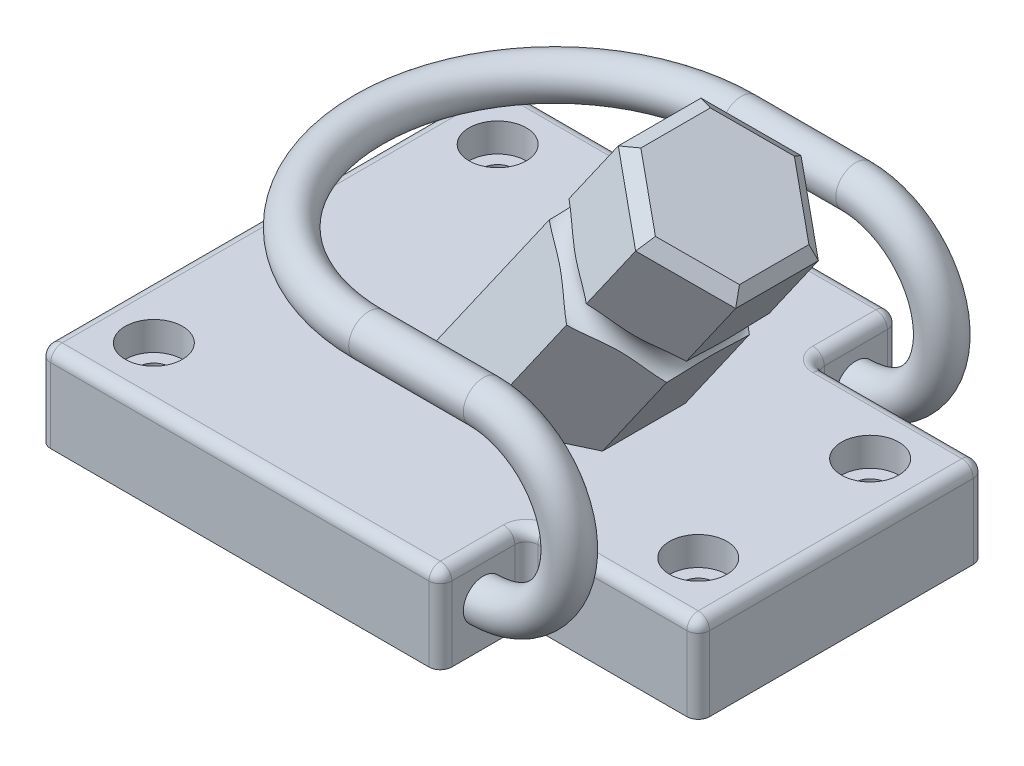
ISO-10303-21;
HEADER;
FILE_DESCRIPTION(('STEP AP214'),'2;1');
FILE_NAME('part.step','',(''),(''),'','','');
FILE_SCHEMA(('AUTOMOTIVE_DESIGN { 1 0 10303 214 1 1 1 1 }'));
ENDSEC;
DATA;
#1=APPLICATION_CONTEXT('core data for automotive mechanical design processes');
#2=APPLICATION_PROTOCOL_DEFINITION('international standard','automotive_design',2000,#1);
#3=PRODUCT_CONTEXT('',#1,'mechanical');
#4=PRODUCT('Part','Part','',(#3));
#5=PRODUCT_RELATED_PRODUCT_CATEGORY('part','',(#4));
#6=PRODUCT_DEFINITION_FORMATION('','',#4);
#7=PRODUCT_DEFINITION_CONTEXT('part definition',#1,'design');
#8=PRODUCT_DEFINITION('design','',#6,#7);
#9=PRODUCT_DEFINITION_SHAPE('','',#8);
#10=(LENGTH_UNIT() NAMED_UNIT(*) SI_UNIT(.MILLI.,.METRE.));
#11=(NAMED_UNIT(*) PLANE_ANGLE_UNIT() SI_UNIT($,.RADIAN.));
#12=(NAMED_UNIT(*) SI_UNIT($,.STERADIAN.) SOLID_ANGLE_UNIT());
#13=UNCERTAINTY_MEASURE_WITH_UNIT(LENGTH_MEASURE(1.E-05),#10,'distance_accuracy_value','');
#14=(GEOMETRIC_REPRESENTATION_CONTEXT(3) GLOBAL_UNCERTAINTY_ASSIGNED_CONTEXT((#13)) GLOBAL_UNIT_ASSIGNED_CONTEXT((#10,
#11,#12)) REPRESENTATION_CONTEXT('',''));
#15=CARTESIAN_POINT('',(0.,0.,0.));
#16=DIRECTION('',(0.,0.,1.));
#17=DIRECTION('',(1.,0.,0.));
#18=AXIS2_PLACEMENT_3D('',#15,#16,#17);
#19=CARTESIAN_POINT('',(34.4145861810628,64.1491226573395,-7.21687836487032));
#20=DIRECTION('',(0.819152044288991,-0.573576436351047,0.));
#21=DIRECTION('',(0.573576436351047,0.819152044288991,0.));
#22=AXIS2_PLACEMENT_3D('',#19,#20,#21);
#23=PLANE('',#22);
#24=CARTESIAN_POINT('',(21.2227464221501,45.3092230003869,-7.21707836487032));
#25=CARTESIAN_POINT('',(21.2243789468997,45.311554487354,-6.96288456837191));
#26=CARTESIAN_POINT('',(21.2305275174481,45.320335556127,-6.7089670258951));
#27=CARTESIAN_POINT('',(21.2499006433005,45.3480032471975,-6.20224229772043));
#28=CARTESIAN_POINT('',(21.2631164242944,45.3668773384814,-5.94943412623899));
#29=CARTESIAN_POINT('',(21.2946700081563,45.4119405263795,-5.44503944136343));
#30=CARTESIAN_POINT('',(21.3130040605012,45.4381242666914,-5.1934521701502));
#31=CARTESIAN_POINT('',(21.3529535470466,45.4951780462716,-4.69106334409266));
#32=CARTESIAN_POINT('',(21.3745693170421,45.5260485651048,-4.44026187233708));
#33=CARTESIAN_POINT('',(21.4188366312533,45.5892688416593,-3.94302253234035));
#34=CARTESIAN_POINT('',(21.4414663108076,45.621587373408,-3.6965785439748));
#35=CARTESIAN_POINT('',(21.4861784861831,45.6854429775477,-3.20354535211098));
#36=CARTESIAN_POINT('',(21.508261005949,45.7169800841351,-2.95695615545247));
#37=CARTESIAN_POINT('',(21.5498653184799,45.776397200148,-2.46329689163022));
#38=CARTESIAN_POINT('',(21.5693890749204,45.8042800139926,-2.21622734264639));
#39=CARTESIAN_POINT('',(21.6038687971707,45.8535221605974,-1.72111094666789));
#40=CARTESIAN_POINT('',(21.6188253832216,45.8748823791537,-1.47306423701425));
#41=CARTESIAN_POINT('',(21.6389299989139,45.903594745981,-1.04913412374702));
#42=CARTESIAN_POINT('',(21.6456690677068,45.9132191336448,-0.873482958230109));
#43=CARTESIAN_POINT('',(21.6555458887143,45.9273246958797,-0.521866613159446));
#44=CARTESIAN_POINT('',(21.6586836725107,45.9318059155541,-0.345901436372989));
#45=CARTESIAN_POINT('',(21.6611353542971,45.9353072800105,0.00609647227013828));
#46=CARTESIAN_POINT('',(21.6604495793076,45.9343278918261,0.182129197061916));
#47=CARTESIAN_POINT('',(21.6553043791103,45.9269797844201,0.534024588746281));
#48=CARTESIAN_POINT('',(21.6508449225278,45.9206110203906,0.709887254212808));
#49=CARTESIAN_POINT('',(21.6384564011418,45.9029183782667,1.06134730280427));
#50=CARTESIAN_POINT('',(21.6305250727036,45.8915912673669,1.23694443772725));
#51=CARTESIAN_POINT('',(21.6117081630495,45.8647179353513,1.58765144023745));
#52=CARTESIAN_POINT('',(21.6008225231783,45.8491716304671,1.76276129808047));
#53=CARTESIAN_POINT('',(21.5646782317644,45.7975522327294,2.28755641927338));
#54=CARTESIAN_POINT('',(21.5359412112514,45.7565115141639,2.63649361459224));
#55=CARTESIAN_POINT('',(21.4746164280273,45.6689306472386,3.33652575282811));
#56=CARTESIAN_POINT('',(21.4419957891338,45.6223435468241,3.68761116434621));
#57=CARTESIAN_POINT('',(21.3787734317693,45.5320526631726,4.39004720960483));
#58=CARTESIAN_POINT('',(21.3481699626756,45.488346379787,4.74139733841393));
#59=CARTESIAN_POINT('',(21.2941767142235,45.4112360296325,5.44529058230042));
#60=CARTESIAN_POINT('',(21.2707743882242,45.3778140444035,5.79783052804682));
#61=CARTESIAN_POINT('',(21.2448385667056,45.3407738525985,6.32851138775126));
#62=CARTESIAN_POINT('',(21.2377179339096,45.3306045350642,6.5059513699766));
#63=CARTESIAN_POINT('',(21.2272370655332,45.3156363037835,6.86125527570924));
#64=CARTESIAN_POINT('',(21.2238788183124,45.310840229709,7.03911937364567));
#65=CARTESIAN_POINT('',(21.2227464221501,45.3092230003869,7.21707836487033));
#66=B_SPLINE_CURVE_WITH_KNOTS('',3,(#24,#25,#26,#27,#28,#29,#30,#31,#32,#33,#34,#35,#36,#37,#38,
#39,#40,#41,#42,#43,#44,#45,#46,#47,#48,#49,#50,#51,#52,#53,#54,#55,#56,#57,#58,#59,#60,#61,#62,
#63,#64,#65),.UNSPECIFIED.,.F.,.F.,(4,2,2,2,2,2,2,2,2,2,2,2,2,2,2,2,2,2,2,2,4),(0.,
0.762239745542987,1.52353532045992,2.28427449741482,3.04509156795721,3.79384205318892,
4.5425597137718,5.29069937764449,6.03873739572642,6.56677019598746,7.0947983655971,
7.62278137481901,8.15076877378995,8.67910093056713,9.20744357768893,10.2647706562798,
11.3317874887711,12.3978657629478,13.4620759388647,13.9955858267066,14.5293775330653),.UNSPECIFIED.);
#67=CARTESIAN_POINT('',(21.2227476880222,45.3092248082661,-7.21687836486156));
#68=VERTEX_POINT('',#67);
#69=CARTESIAN_POINT('',(21.2227476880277,45.3092248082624,7.21687836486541));
#70=VERTEX_POINT('',#69);
#71=EDGE_CURVE('E289',#68,#70,#66,.T.);
#72=ORIENTED_EDGE('',*,*,#71,.F.);
#73=DIRECTION('',(-0.573576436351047,-0.819152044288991,0.));
#74=VECTOR('',#73,1.);
#75=CARTESIAN_POINT('',(34.4145861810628,64.1491226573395,-7.21687836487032));
#76=LINE('',#75,#74);
#77=CARTESIAN_POINT('',(0.,15.,-7.21687836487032));
#78=VERTEX_POINT('',#77);
#79=EDGE_CURVE('E302',#68,#78,#76,.T.);
#80=ORIENTED_EDGE('',*,*,#79,.T.);
#81=DIRECTION('',(0.,0.,1.));
#82=VECTOR('',#81,1.);
#83=CARTESIAN_POINT('',(0.,15.,-7.21687836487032));
#84=LINE('',#83,#82);
#85=CARTESIAN_POINT('',(0.,15.,7.21687836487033));
#86=VERTEX_POINT('',#85);
#87=EDGE_CURVE('E313',#78,#86,#84,.T.);
#88=ORIENTED_EDGE('',*,*,#87,.T.);
#89=DIRECTION('',(-0.573576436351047,-0.819152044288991,0.));
#90=VECTOR('',#89,1.);
#91=CARTESIAN_POINT('',(34.4145861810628,64.1491226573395,7.21687836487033));
#92=LINE('',#91,#90);
#93=EDGE_CURVE('E304',#70,#86,#92,.T.);
#94=ORIENTED_EDGE('',*,*,#93,.F.);
#95=EDGE_LOOP('',(#72,#80,#88,#94));
#96=FACE_BOUND('',#95,.T.);
#97=ADVANCED_FACE('F51',(#96),#23,.F.);
#98=CARTESIAN_POINT('',(34.4145861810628,64.1491226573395,7.21687836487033));
#99=DIRECTION('',(0.409576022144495,-0.286788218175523,-0.866025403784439));
#100=DIRECTION('',(-0.903998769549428,0.,-0.427535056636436));
#101=AXIS2_PLACEMENT_3D('',#98,#99,#100);
#102=PLANE('',#101);
#103=CARTESIAN_POINT('',(21.2224613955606,45.3094198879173,7.21667836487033));
#104=CARTESIAN_POINT('',(21.4044186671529,45.185481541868,7.34377555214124));
#105=CARTESIAN_POINT('',(21.590696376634,45.0681303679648,7.47073466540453));
#106=CARTESIAN_POINT('',(21.9695406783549,44.8440858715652,7.72409774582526));
#107=CARTESIAN_POINT('',(22.1620991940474,44.7373795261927,7.85050220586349));
#108=CARTESIAN_POINT('',(22.5514718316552,44.5318895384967,8.1027001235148));
#109=CARTESIAN_POINT('',(22.7482827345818,44.4331001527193,8.22849396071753));
#110=CARTESIAN_POINT('',(23.1446289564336,44.2405987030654,8.47968873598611));
#111=CARTESIAN_POINT('',(23.3441645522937,44.1468871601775,8.60508963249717));
#112=CARTESIAN_POINT('',(23.7411765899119,43.9631115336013,8.85370970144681));
#113=CARTESIAN_POINT('',(23.9386355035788,43.8730131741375,8.97693193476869));
#114=CARTESIAN_POINT('',(24.3331095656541,43.6919636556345,9.22344893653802));
#115=CARTESIAN_POINT('',(24.5301247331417,43.6010125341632,9.34674370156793));
#116=CARTESIAN_POINT('',(24.9219360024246,43.4152150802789,9.5935736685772));
#117=CARTESIAN_POINT('',(25.1167336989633,43.3203718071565,9.7171086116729));
#118=CARTESIAN_POINT('',(25.5024550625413,43.1236770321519,9.96466713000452));
#119=CARTESIAN_POINT('',(25.6933792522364,43.0218264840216,10.0886906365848));
#120=CARTESIAN_POINT('',(26.0142316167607,42.8399596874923,10.3006598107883));
#121=CARTESIAN_POINT('',(26.1455858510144,42.762330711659,10.3884893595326));
#122=CARTESIAN_POINT('',(26.4049156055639,42.6017732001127,10.5643055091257));
#123=CARTESIAN_POINT('',(26.5328911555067,42.5188447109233,10.6522921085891));
#124=CARTESIAN_POINT('',(26.7850659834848,42.3474926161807,10.8282990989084));
#125=CARTESIAN_POINT('',(26.9092655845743,42.2590694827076,10.9163194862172));
#126=CARTESIAN_POINT('',(27.1537701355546,42.0769177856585,11.0922752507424));
#127=CARTESIAN_POINT('',(27.2740750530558,41.9831891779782,11.1802106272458));
#128=CARTESIAN_POINT('',(27.5110266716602,41.7909080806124,11.3559487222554));
#129=CARTESIAN_POINT('',(27.6276709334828,41.6923524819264,11.4437513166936));
#130=CARTESIAN_POINT('',(27.8576591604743,41.4912637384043,11.6191128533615));
#131=CARTESIAN_POINT('',(27.9710030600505,41.3887305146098,11.7066717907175));
#132=CARTESIAN_POINT('',(28.3071678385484,41.0764152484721,11.9690813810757));
#133=CARTESIAN_POINT('',(28.5259792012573,40.8620366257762,12.1435579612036));
#134=CARTESIAN_POINT('',(28.9612816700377,40.4267075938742,12.4935900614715));
#135=CARTESIAN_POINT('',(29.1777331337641,40.2057149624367,12.6691408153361));
#136=CARTESIAN_POINT('',(29.6128436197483,39.7664819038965,13.020374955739));
#137=CARTESIAN_POINT('',(29.8315005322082,39.5482392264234,13.1960580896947));
#138=CARTESIAN_POINT('',(30.2768757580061,39.1214649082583,13.5480210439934));
#139=CARTESIAN_POINT('',(30.5035792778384,38.9129169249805,13.7242992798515));
#140=CARTESIAN_POINT('',(30.8541310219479,38.6122602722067,13.9896522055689));
#141=CARTESIAN_POINT('',(30.9728941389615,38.5139476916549,14.0783764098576));
#142=CARTESIAN_POINT('',(31.2144820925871,38.3224831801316,14.2560367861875));
#143=CARTESIAN_POINT('',(31.337309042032,38.2293340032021,14.3449730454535));
#144=CARTESIAN_POINT('',(31.4624294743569,38.1393170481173,14.4339567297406));
#145=B_SPLINE_CURVE_WITH_KNOTS('',3,(#103,#104,#105,#106,#107,#108,#109,#110,#111,#112,#113,
#114,#115,#116,#117,#118,#119,#120,#121,#122,#123,#124,#125,#126,#127,#128,#129,#130,#131,#132,
#133,#134,#135,#136,#137,#138,#139,#140,#141,#142,#143,#144),.UNSPECIFIED.,.F.,.F.,(4,2,2,2,2,2,
2,2,2,2,2,2,2,2,2,2,2,2,2,2,4),(0.,0.76224129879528,1.52353833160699,2.28427797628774,
3.04509552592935,3.79384736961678,4.54256638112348,5.2907077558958,6.03874750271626,
6.5668045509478,7.09485696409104,7.62286407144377,8.15087556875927,8.67923174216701,
9.20759840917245,10.2649737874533,11.3320396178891,12.398166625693,13.4624259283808,
13.9959607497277,14.5297774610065),.UNSPECIFIED.);
#146=CARTESIAN_POINT('',(31.4621482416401,38.1395193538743,14.4337567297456));
#147=VERTEX_POINT('',#146);
#148=EDGE_CURVE('E306',#70,#147,#145,.T.);
#149=ORIENTED_EDGE('',*,*,#148,.F.);
#150=ORIENTED_EDGE('',*,*,#93,.T.);
#151=DIRECTION('',(-0.903998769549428,0.,-0.427535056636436));
#152=VECTOR('',#151,1.);
#153=CARTESIAN_POINT('',(-2.78925972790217,15.,5.8977324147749));
#154=LINE('',#153,#152);
#155=CARTESIAN_POINT('',(15.2596823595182,15.,14.4337567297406));
#156=VERTEX_POINT('',#155);
#157=EDGE_CURVE('E297',#156,#86,#154,.T.);
#158=ORIENTED_EDGE('',*,*,#157,.F.);
#159=DIRECTION('',(-0.573576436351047,-0.819152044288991,0.));
#160=VECTOR('',#159,1.);
#161=CARTESIAN_POINT('',(44.6539867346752,56.9794172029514,14.4337567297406));
#162=LINE('',#161,#160);
#163=EDGE_CURVE('E328',#147,#156,#162,.T.);
#164=ORIENTED_EDGE('',*,*,#163,.F.);
#165=EDGE_LOOP('',(#149,#150,#158,#164));
#166=FACE_BOUND('',#165,.T.);
#167=ADVANCED_FACE('F455',(#166),#102,.F.);
#168=CARTESIAN_POINT('',(44.6539867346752,56.9794172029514,14.4337567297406));
#169=DIRECTION('',(-0.409576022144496,0.286788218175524,-0.866025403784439));
#170=DIRECTION('',(-0.903998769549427,0.,0.427535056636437));
#171=AXIS2_PLACEMENT_3D('',#168,#169,#170);
#172=PLANE('',#171);
#173=CARTESIAN_POINT('',(31.461861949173,38.1397144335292,14.4339567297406));
#174=CARTESIAN_POINT('',(31.6438192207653,38.0157760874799,14.3068595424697));
#175=CARTESIAN_POINT('',(31.8300969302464,37.8984249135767,14.1799004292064));
#176=CARTESIAN_POINT('',(32.2089412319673,37.6743804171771,13.9265373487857));
#177=CARTESIAN_POINT('',(32.4014997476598,37.5676740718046,13.8001328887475));
#178=CARTESIAN_POINT('',(32.7908723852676,37.3621840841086,13.5479349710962));
#179=CARTESIAN_POINT('',(32.9876832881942,37.2633946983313,13.4221411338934));
#180=CARTESIAN_POINT('',(33.384029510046,37.0708932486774,13.1709463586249));
#181=CARTESIAN_POINT('',(33.5835651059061,36.9771817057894,13.0455454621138));
#182=CARTESIAN_POINT('',(33.9805771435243,36.7934060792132,12.7969253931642));
#183=CARTESIAN_POINT('',(34.1780360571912,36.7033077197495,12.6737031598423));
#184=CARTESIAN_POINT('',(34.5725101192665,36.5222582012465,12.427186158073));
#185=CARTESIAN_POINT('',(34.7695252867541,36.4313070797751,12.303891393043));
#186=CARTESIAN_POINT('',(35.161336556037,36.2455096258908,12.0570614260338));
#187=CARTESIAN_POINT('',(35.3561342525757,36.1506663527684,11.9335264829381));
#188=CARTESIAN_POINT('',(35.7418556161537,35.9539715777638,11.6859679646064));
#189=CARTESIAN_POINT('',(35.9327798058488,35.8521210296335,11.5619444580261));
#190=CARTESIAN_POINT('',(36.2536321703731,35.6702542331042,11.3499752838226));
#191=CARTESIAN_POINT('',(36.3849864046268,35.5926252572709,11.2621457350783));
#192=CARTESIAN_POINT('',(36.6443161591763,35.4320677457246,11.0863295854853));
#193=CARTESIAN_POINT('',(36.7722917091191,35.3491392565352,10.9983429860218));
#194=CARTESIAN_POINT('',(37.0244665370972,35.1777871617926,10.8223359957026));
#195=CARTESIAN_POINT('',(37.1486661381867,35.0893640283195,10.7343156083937));
#196=CARTESIAN_POINT('',(37.393170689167,34.9072123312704,10.5583598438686));
#197=CARTESIAN_POINT('',(37.5134756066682,34.8134837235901,10.4704244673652));
#198=CARTESIAN_POINT('',(37.7504272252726,34.6212026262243,10.2946863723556));
#199=CARTESIAN_POINT('',(37.8670714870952,34.5226470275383,10.2068837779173));
#200=CARTESIAN_POINT('',(38.0970597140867,34.3215582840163,10.0315222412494));
#201=CARTESIAN_POINT('',(38.2104036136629,34.2190250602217,9.94396330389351));
#202=CARTESIAN_POINT('',(38.5465683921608,33.906709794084,9.68155371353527));
#203=CARTESIAN_POINT('',(38.7653797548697,33.6923311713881,9.50707713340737));
#204=CARTESIAN_POINT('',(39.2006822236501,33.2570021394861,9.15704503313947));
#205=CARTESIAN_POINT('',(39.4171336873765,33.0360095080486,8.98149427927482));
#206=CARTESIAN_POINT('',(39.8522441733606,32.5967764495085,8.63026013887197));
#207=CARTESIAN_POINT('',(40.0709010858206,32.3785337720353,8.45457700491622));
#208=CARTESIAN_POINT('',(40.5162763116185,31.9517594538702,8.1026140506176));
#209=CARTESIAN_POINT('',(40.7429798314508,31.7432114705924,7.92633581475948));
#210=CARTESIAN_POINT('',(41.0935315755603,31.4425548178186,7.66098288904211));
#211=CARTESIAN_POINT('',(41.2122946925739,31.3442422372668,7.5722586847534));
#212=CARTESIAN_POINT('',(41.4538826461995,31.1527777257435,7.39459830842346));
#213=CARTESIAN_POINT('',(41.5767095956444,31.059628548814,7.30566204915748));
#214=CARTESIAN_POINT('',(41.7018300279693,30.9696115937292,7.21667836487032));
#215=B_SPLINE_CURVE_WITH_KNOTS('',3,(#173,#174,#175,#176,#177,#178,#179,#180,#181,#182,#183,
#184,#185,#186,#187,#188,#189,#190,#191,#192,#193,#194,#195,#196,#197,#198,#199,#200,#201,#202,
#203,#204,#205,#206,#207,#208,#209,#210,#211,#212,#213,#214),.UNSPECIFIED.,.F.,.F.,(4,2,2,2,2,2,
2,2,2,2,2,2,2,2,2,2,2,2,2,2,4),(0.,0.762241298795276,1.52353833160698,2.28427797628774,
3.04509552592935,3.79384736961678,4.54256638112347,5.29070775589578,6.03874750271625,
6.5668045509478,7.09485696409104,7.62286407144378,8.15087556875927,8.67923174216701,
9.20759840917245,10.2649737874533,11.3320396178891,12.398166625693,13.4624259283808,
13.9959607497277,14.5297774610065),.UNSPECIFIED.);
#216=CARTESIAN_POINT('',(41.7015487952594,30.9698138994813,7.21687836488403));
#217=VERTEX_POINT('',#216);
#218=EDGE_CURVE('E408',#147,#217,#215,.T.);
#219=ORIENTED_EDGE('',*,*,#218,.F.);
#220=ORIENTED_EDGE('',*,*,#163,.T.);
#221=DIRECTION('',(-0.903998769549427,0.,0.427535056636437));
#222=VECTOR('',#221,1.);
#223=CARTESIAN_POINT('',(8.3677791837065,15.,17.6931972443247));
#224=LINE('',#223,#222);
#225=CARTESIAN_POINT('',(30.5193647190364,15.,7.21687836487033));
#226=VERTEX_POINT('',#225);
#227=EDGE_CURVE('E364',#226,#156,#224,.T.);
#228=ORIENTED_EDGE('',*,*,#227,.F.);
#229=DIRECTION('',(-0.573576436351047,-0.819152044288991,0.));
#230=VECTOR('',#229,1.);
#231=CARTESIAN_POINT('',(54.8933872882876,49.8097117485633,7.21687836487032));
#232=LINE('',#231,#230);
#233=EDGE_CURVE('E325',#217,#226,#232,.T.);
#234=ORIENTED_EDGE('',*,*,#233,.F.);
#235=EDGE_LOOP('',(#219,#220,#228,#234));
#236=FACE_BOUND('',#235,.T.);
#237=ADVANCED_FACE('F456',(#236),#172,.F.);
#238=CARTESIAN_POINT('',(54.8933872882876,49.8097117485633,7.21687836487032));
#239=DIRECTION('',(-0.819152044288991,0.573576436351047,0.));
#240=DIRECTION('',(-0.573576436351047,-0.819152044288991,0.));
#241=AXIS2_PLACEMENT_3D('',#238,#239,#240);
#242=PLANE('',#241);
#243=CARTESIAN_POINT('',(41.7015475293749,30.9698120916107,7.21707836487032));
#244=CARTESIAN_POINT('',(41.7031800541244,30.9721435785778,6.96288456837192));
#245=CARTESIAN_POINT('',(41.7093286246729,30.9809246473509,6.70896702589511));
#246=CARTESIAN_POINT('',(41.7287017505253,31.0085923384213,6.20224229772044));
#247=CARTESIAN_POINT('',(41.7419175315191,31.0274664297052,5.94943412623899));
#248=CARTESIAN_POINT('',(41.7734711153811,31.0725296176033,5.44503944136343));
#249=CARTESIAN_POINT('',(41.791805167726,31.0987133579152,5.1934521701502));
#250=CARTESIAN_POINT('',(41.8317546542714,31.1557671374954,4.69106334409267));
#251=CARTESIAN_POINT('',(41.8533704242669,31.1866376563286,4.44026187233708));
#252=CARTESIAN_POINT('',(41.8976377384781,31.2498579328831,3.94302253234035));
#253=CARTESIAN_POINT('',(41.9202674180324,31.2821764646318,3.6965785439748));
#254=CARTESIAN_POINT('',(41.9649795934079,31.3460320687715,3.20354535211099));
#255=CARTESIAN_POINT('',(41.9870621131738,31.3775691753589,2.95695615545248));
#256=CARTESIAN_POINT('',(42.0286664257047,31.4369862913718,2.46329689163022));
#257=CARTESIAN_POINT('',(42.0481901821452,31.4648691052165,2.21622734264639));
#258=CARTESIAN_POINT('',(42.0826699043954,31.5141112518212,1.72111094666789));
#259=CARTESIAN_POINT('',(42.0976264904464,31.5354714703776,1.47306423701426));
#260=CARTESIAN_POINT('',(42.1177311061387,31.5641838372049,1.04913412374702));
#261=CARTESIAN_POINT('',(42.1244701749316,31.5738082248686,0.873482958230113));
#262=CARTESIAN_POINT('',(42.1343469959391,31.5879137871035,0.521866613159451));
#263=CARTESIAN_POINT('',(42.1374847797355,31.5923950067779,0.345901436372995));
#264=CARTESIAN_POINT('',(42.1399364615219,31.5958963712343,-0.00609647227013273));
#265=CARTESIAN_POINT('',(42.1392506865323,31.5949169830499,-0.182129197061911));
#266=CARTESIAN_POINT('',(42.1341054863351,31.5875688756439,-0.534024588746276));
#267=CARTESIAN_POINT('',(42.1296460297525,31.5812001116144,-0.709887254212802));
#268=CARTESIAN_POINT('',(42.1172575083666,31.5635074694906,-1.06134730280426));
#269=CARTESIAN_POINT('',(42.1093261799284,31.5521803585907,-1.23694443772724));
#270=CARTESIAN_POINT('',(42.0905092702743,31.5253070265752,-1.58765144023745));
#271=CARTESIAN_POINT('',(42.0796236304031,31.509760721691,-1.76276129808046));
#272=CARTESIAN_POINT('',(42.0434793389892,31.4581413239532,-2.28755641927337));
#273=CARTESIAN_POINT('',(42.0147423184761,31.4171006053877,-2.63649361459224));
#274=CARTESIAN_POINT('',(41.9534175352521,31.3295197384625,-3.3365257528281));
#275=CARTESIAN_POINT('',(41.9207968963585,31.2829326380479,-3.6876111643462));
#276=CARTESIAN_POINT('',(41.8575745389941,31.1926417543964,-4.39004720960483));
#277=CARTESIAN_POINT('',(41.8269710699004,31.1489354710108,-4.74139733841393));
#278=CARTESIAN_POINT('',(41.7729778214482,31.0718251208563,-5.44529058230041));
#279=CARTESIAN_POINT('',(41.7495754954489,31.0384031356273,-5.79783052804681));
#280=CARTESIAN_POINT('',(41.7236396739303,31.0013629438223,-6.32851138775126));
#281=CARTESIAN_POINT('',(41.7165190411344,30.9911936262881,-6.50595136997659));
#282=CARTESIAN_POINT('',(41.706038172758,30.9762253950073,-6.86125527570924));
#283=CARTESIAN_POINT('',(41.7026799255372,30.9714293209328,-7.03911937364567));
#284=CARTESIAN_POINT('',(41.7015475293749,30.9698120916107,-7.21707836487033));
#285=B_SPLINE_CURVE_WITH_KNOTS('',3,(#243,#244,#245,#246,#247,#248,#249,#250,#251,#252,#253,
#254,#255,#256,#257,#258,#259,#260,#261,#262,#263,#264,#265,#266,#267,#268,#269,#270,#271,#272,
#273,#274,#275,#276,#277,#278,#279,#280,#281,#282,#283,#284),.UNSPECIFIED.,.F.,.F.,(4,2,2,2,2,2,
2,2,2,2,2,2,2,2,2,2,2,2,2,2,4),(0.,0.762239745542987,1.52353532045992,2.28427449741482,
3.04509156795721,3.79384205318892,4.5425597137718,5.29069937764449,6.03873739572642,
6.56677019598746,7.0947983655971,7.62278137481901,8.15076877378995,8.67910093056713,
9.20744357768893,10.2647706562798,11.3317874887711,12.3978657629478,13.4620759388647,
13.9955858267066,14.5293775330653),.UNSPECIFIED.);
#286=CARTESIAN_POINT('',(41.7015487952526,30.9698138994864,-7.21687836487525));
#287=VERTEX_POINT('',#286);
#288=EDGE_CURVE('E401',#217,#287,#285,.T.);
#289=ORIENTED_EDGE('',*,*,#288,.F.);
#290=ORIENTED_EDGE('',*,*,#233,.T.);
#291=DIRECTION('',(0.,0.,1.));
#292=VECTOR('',#291,1.);
#293=CARTESIAN_POINT('',(30.5193647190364,15.,0.));
#294=LINE('',#293,#292);
#295=CARTESIAN_POINT('',(30.5193647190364,15.,-7.21687836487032));
#296=VERTEX_POINT('',#295);
#297=EDGE_CURVE('E361',#296,#226,#294,.T.);
#298=ORIENTED_EDGE('',*,*,#297,.F.);
#299=DIRECTION('',(-0.573576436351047,-0.819152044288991,0.));
#300=VECTOR('',#299,1.);
#301=CARTESIAN_POINT('',(54.8933872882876,49.8097117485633,-7.21687836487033));
#302=LINE('',#301,#300);
#303=EDGE_CURVE('E322',#287,#296,#302,.T.);
#304=ORIENTED_EDGE('',*,*,#303,.F.);
#305=EDGE_LOOP('',(#289,#290,#298,#304));
#306=FACE_BOUND('',#305,.T.);
#307=ADVANCED_FACE('F631',(#306),#242,.F.);
#308=CARTESIAN_POINT('',(54.8933872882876,49.8097117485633,-7.21687836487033));
#309=DIRECTION('',(-0.409576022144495,0.286788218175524,0.866025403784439));
#310=DIRECTION('',(0.903998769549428,0.,0.427535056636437));
#311=AXIS2_PLACEMENT_3D('',#308,#309,#310);
#312=PLANE('',#311);
#313=CARTESIAN_POINT('',(41.7018300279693,30.9696115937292,-7.21667836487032));
#314=CARTESIAN_POINT('',(41.5231330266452,31.0982060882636,-7.34377555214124));
#315=CARTESIAN_POINT('',(41.3491482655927,31.233113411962,-7.47073466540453));
#316=CARTESIAN_POINT('',(41.0090429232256,31.512482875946,-7.72409774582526));
#317=CARTESIAN_POINT('',(40.8429128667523,31.6569329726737,-7.85050220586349));
#318=CARTESIAN_POINT('',(40.5166421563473,31.9525418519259,-8.1027001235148));
#319=CARTESIAN_POINT('',(40.3564972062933,32.1036956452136,-8.22849396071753));
#320=CARTESIAN_POINT('',(40.0400466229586,32.4102998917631,-8.47968873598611));
#321=CARTESIAN_POINT('',(39.8837413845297,32.5657507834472,-8.60508963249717));
#322=CARTESIAN_POINT('',(39.5752626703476,32.8759650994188,-8.8537097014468));
#323=CARTESIAN_POINT('',(39.4230629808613,33.0307003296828,-8.97693193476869));
#324=CARTESIAN_POINT('',(39.1180140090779,33.339462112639,-9.22344893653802));
#325=CARTESIAN_POINT('',(38.9651647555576,33.4934886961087,-9.34674370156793));
#326=CARTESIAN_POINT('',(38.656564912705,33.7981243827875,-9.5935736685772));
#327=CARTESIAN_POINT('',(38.500816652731,33.9487360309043,-9.7171086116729));
#328=CARTESIAN_POINT('',(38.1840595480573,34.2439219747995,-9.96466713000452));
#329=CARTESIAN_POINT('',(38.0230514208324,34.3884970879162,-10.0886906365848));
#330=CARTESIAN_POINT('',(37.7424145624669,34.6277975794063,-10.3006598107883));
#331=CARTESIAN_POINT('',(37.6245413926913,34.7246795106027,-10.3884893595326));
#332=CARTESIAN_POINT('',(37.3849706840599,34.913455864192,-10.5643055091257));
#333=CARTESIAN_POINT('',(37.263273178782,35.0053503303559,-10.6522921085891));
#334=CARTESIAN_POINT('',(37.016006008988,35.1837112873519,-10.8282990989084));
#335=CARTESIAN_POINT('',(36.890436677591,35.2701782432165,-10.9163194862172));
#336=CARTESIAN_POINT('',(36.6356445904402,35.4376378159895,-11.0922752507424));
#337=CARTESIAN_POINT('',(36.5064218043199,35.5186303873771,-11.1802106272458));
#338=CARTESIAN_POINT('',(36.2446944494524,35.675528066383,-11.3559487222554));
#339=CARTESIAN_POINT('',(36.1121877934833,35.7514298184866,-11.4437513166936));
#340=CARTESIAN_POINT('',(35.8445655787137,35.8987716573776,-11.6191128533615));
#341=CARTESIAN_POINT('',(35.7094499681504,35.9702116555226,-11.7066717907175));
#342=CARTESIAN_POINT('',(35.3009944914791,36.179285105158,-11.9690813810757));
#343=CARTESIAN_POINT('',(35.0247065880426,36.3115787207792,-12.1435579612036));
#344=CARTESIAN_POINT('',(34.4667488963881,36.5717379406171,-12.4935900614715));
#345=CARTESIAN_POINT('',(34.1850529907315,36.699551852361,-12.6691408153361));
#346=CARTESIAN_POINT('',(33.6234923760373,36.9581954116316,-13.020374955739));
#347=CARTESIAN_POINT('',(33.3436262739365,37.0890223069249,-13.1960580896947));
#348=CARTESIAN_POINT('',(32.7902622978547,37.3615727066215,-13.5480210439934));
#349=CARTESIAN_POINT('',(32.5167541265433,37.5032767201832,-13.7242992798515));
#350=CARTESIAN_POINT('',(32.1143335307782,37.7298569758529,-13.9896522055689));
#351=CARTESIAN_POINT('',(31.9813305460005,37.8078329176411,-14.0783764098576));
#352=CARTESIAN_POINT('',(31.7187848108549,37.9693666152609,-14.2560367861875));
#353=CARTESIAN_POINT('',(31.5892439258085,38.0529272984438,-14.3449730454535));
#354=CARTESIAN_POINT('',(31.4618619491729,38.1397144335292,-14.4339567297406));
#355=B_SPLINE_CURVE_WITH_KNOTS('',3,(#313,#314,#315,#316,#317,#318,#319,#320,#321,#322,#323,
#324,#325,#326,#327,#328,#329,#330,#331,#332,#333,#334,#335,#336,#337,#338,#339,#340,#341,#342,
#343,#344,#345,#346,#347,#348,#349,#350,#351,#352,#353,#354),.UNSPECIFIED.,.F.,.F.,(4,2,2,2,2,2,
2,2,2,2,2,2,2,2,2,2,2,2,2,2,4),(0.,0.762241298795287,1.52353833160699,2.28427797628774,
3.04509552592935,3.79384736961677,4.54256638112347,5.29070775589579,6.03874750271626,
6.5668045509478,7.09485696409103,7.62286407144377,8.15087556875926,8.679231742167,
9.20759840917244,10.2649737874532,11.3320396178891,12.398166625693,13.4624259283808,
13.9959607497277,14.5297774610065),.UNSPECIFIED.);
#356=CARTESIAN_POINT('',(31.4621482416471,38.1395193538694,-14.4337567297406));
#357=VERTEX_POINT('',#356);
#358=EDGE_CURVE('E292',#287,#357,#355,.T.);
#359=ORIENTED_EDGE('',*,*,#358,.F.);
#360=ORIENTED_EDGE('',*,*,#303,.T.);
#361=DIRECTION('',(0.903998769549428,0.,0.427535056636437));
#362=VECTOR('',#361,1.);
#363=CARTESIAN_POINT('',(8.36777918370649,15.,-17.6931972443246));
#364=LINE('',#363,#362);
#365=CARTESIAN_POINT('',(15.2596823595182,15.,-14.4337567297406));
#366=VERTEX_POINT('',#365);
#367=EDGE_CURVE('E358',#366,#296,#364,.T.);
#368=ORIENTED_EDGE('',*,*,#367,.F.);
#369=DIRECTION('',(-0.573576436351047,-0.819152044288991,0.));
#370=VECTOR('',#369,1.);
#371=CARTESIAN_POINT('',(44.6539867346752,56.9794172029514,-14.4337567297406));
#372=LINE('',#371,#370);
#373=EDGE_CURVE('E315',#357,#366,#372,.T.);
#374=ORIENTED_EDGE('',*,*,#373,.F.);
#375=EDGE_LOOP('',(#359,#360,#368,#374));
#376=FACE_BOUND('',#375,.T.);
#377=ADVANCED_FACE('F897',(#376),#312,.F.);
#378=CARTESIAN_POINT('',(44.6539867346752,56.9794172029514,-14.4337567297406));
#379=DIRECTION('',(0.409576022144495,-0.286788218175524,0.866025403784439));
#380=DIRECTION('',(0.903998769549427,0.,-0.427535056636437));
#381=AXIS2_PLACEMENT_3D('',#378,#379,#380);
#382=PLANE('',#381);
#383=CARTESIAN_POINT('',(31.4624294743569,38.1393170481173,-14.4339567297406));
#384=CARTESIAN_POINT('',(31.2837324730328,38.2679115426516,-14.3068595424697));
#385=CARTESIAN_POINT('',(31.1097477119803,38.4028188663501,-14.1799004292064));
#386=CARTESIAN_POINT('',(30.7696423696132,38.6821883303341,-13.9265373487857));
#387=CARTESIAN_POINT('',(30.60351231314,38.8266384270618,-13.8001328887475));
#388=CARTESIAN_POINT('',(30.2772416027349,39.122247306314,-13.5479349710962));
#389=CARTESIAN_POINT('',(30.1170966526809,39.2734010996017,-13.4221411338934));
#390=CARTESIAN_POINT('',(29.8006460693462,39.5800053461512,-13.1709463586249));
#391=CARTESIAN_POINT('',(29.6443408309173,39.7354562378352,-13.0455454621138));
#392=CARTESIAN_POINT('',(29.3358621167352,40.0456705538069,-12.7969253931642));
#393=CARTESIAN_POINT('',(29.1836624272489,40.2004057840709,-12.6737031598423));
#394=CARTESIAN_POINT('',(28.8786134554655,40.5091675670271,-12.427186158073));
#395=CARTESIAN_POINT('',(28.7257642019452,40.6631941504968,-12.303891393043));
#396=CARTESIAN_POINT('',(28.4171643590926,40.9678298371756,-12.0570614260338));
#397=CARTESIAN_POINT('',(28.2614160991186,41.1184414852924,-11.9335264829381));
#398=CARTESIAN_POINT('',(27.9446589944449,41.4136274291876,-11.6859679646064));
#399=CARTESIAN_POINT('',(27.78365086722,41.5582025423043,-11.5619444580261));
#400=CARTESIAN_POINT('',(27.5030140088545,41.7975030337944,-11.3499752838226));
#401=CARTESIAN_POINT('',(27.3851408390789,41.8943849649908,-11.2621457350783));
#402=CARTESIAN_POINT('',(27.1455701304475,42.0831613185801,-11.0863295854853));
#403=CARTESIAN_POINT('',(27.0238726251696,42.175055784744,-10.9983429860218));
#404=CARTESIAN_POINT('',(26.7766054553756,42.35341674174,-10.8223359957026));
#405=CARTESIAN_POINT('',(26.6510361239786,42.4398836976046,-10.7343156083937));
#406=CARTESIAN_POINT('',(26.3962440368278,42.6073432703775,-10.5583598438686));
#407=CARTESIAN_POINT('',(26.2670212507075,42.6883358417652,-10.4704244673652));
#408=CARTESIAN_POINT('',(26.00529389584,42.8452335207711,-10.2946863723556));
#409=CARTESIAN_POINT('',(25.8727872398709,42.9211352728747,-10.2068837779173));
#410=CARTESIAN_POINT('',(25.6051650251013,43.0684771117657,-10.0315222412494));
#411=CARTESIAN_POINT('',(25.470049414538,43.1399171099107,-9.94396330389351));
#412=CARTESIAN_POINT('',(25.0615939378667,43.3489905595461,-9.68155371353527));
#413=CARTESIAN_POINT('',(24.7853060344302,43.4812841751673,-9.50707713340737));
#414=CARTESIAN_POINT('',(24.2273483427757,43.7414433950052,-9.15704503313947));
#415=CARTESIAN_POINT('',(23.9456524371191,43.869257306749,-8.98149427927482));
#416=CARTESIAN_POINT('',(23.3840918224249,44.1279008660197,-8.63026013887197));
#417=CARTESIAN_POINT('',(23.1042257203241,44.258727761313,-8.45457700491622));
#418=CARTESIAN_POINT('',(22.5508617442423,44.5312781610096,-8.1026140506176));
#419=CARTESIAN_POINT('',(22.2773535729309,44.6729821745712,-7.92633581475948));
#420=CARTESIAN_POINT('',(21.8749329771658,44.899562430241,-7.66098288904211));
#421=CARTESIAN_POINT('',(21.7419299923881,44.9775383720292,-7.5722586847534));
#422=CARTESIAN_POINT('',(21.4793842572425,45.139072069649,-7.39459830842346));
#423=CARTESIAN_POINT('',(21.3498433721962,45.2226327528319,-7.30566204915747));
#424=CARTESIAN_POINT('',(21.2224613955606,45.3094198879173,-7.21667836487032));
#425=B_SPLINE_CURVE_WITH_KNOTS('',3,(#383,#384,#385,#386,#387,#388,#389,#390,#391,#392,#393,
#394,#395,#396,#397,#398,#399,#400,#401,#402,#403,#404,#405,#406,#407,#408,#409,#410,#411,#412,
#413,#414,#415,#416,#417,#418,#419,#420,#421,#422,#423,#424),.UNSPECIFIED.,.F.,.F.,(4,2,2,2,2,2,
2,2,2,2,2,2,2,2,2,2,2,2,2,2,4),(0.,0.762241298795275,1.52353833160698,2.28427797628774,
3.04509552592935,3.79384736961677,4.54256638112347,5.29070775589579,6.03874750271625,
6.5668045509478,7.09485696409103,7.62286407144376,8.15087556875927,8.679231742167,
9.20759840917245,10.2649737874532,11.3320396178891,12.398166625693,13.4624259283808,
13.9959607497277,14.5297774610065),.UNSPECIFIED.);
#426=EDGE_CURVE('E285',#357,#68,#425,.T.);
#427=ORIENTED_EDGE('',*,*,#426,.F.);
#428=ORIENTED_EDGE('',*,*,#373,.T.);
#429=DIRECTION('',(0.903998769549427,0.,-0.427535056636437));
#430=VECTOR('',#429,1.);
#431=CARTESIAN_POINT('',(-2.78925972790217,15.,-5.89773241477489));
#432=LINE('',#431,#430);
#433=EDGE_CURVE('E310',#78,#366,#432,.T.);
#434=ORIENTED_EDGE('',*,*,#433,.F.);
#435=ORIENTED_EDGE('',*,*,#79,.F.);
#436=EDGE_LOOP('',(#427,#428,#434,#435));
#437=FACE_BOUND('',#436,.T.);
#438=ADVANCED_FACE('F308',(#437),#382,.F.);
#439=CARTESIAN_POINT('',(0.,15.,0.));
#440=DIRECTION('',(0.,1.,0.));
#441=DIRECTION('',(0.,0.,1.));
#442=AXIS2_PLACEMENT_3D('',#439,#440,#441);
#443=PLANE('',#442);
#444=CARTESIAN_POINT('',(-25.,15.,30.));
#445=DIRECTION('',(0.,1.,0.));
#446=DIRECTION('',(0.,0.,1.));
#447=AXIS2_PLACEMENT_3D('',#444,#445,#446);
#448=CIRCLE('',#447,5.);
#449=CARTESIAN_POINT('',(-25.,15.,35.));
#450=VERTEX_POINT('',#449);
#451=EDGE_CURVE('E1301',#450,#450,#448,.T.);
#452=ORIENTED_EDGE('',*,*,#451,.F.);
#453=EDGE_LOOP('',(#452));
#454=FACE_BOUND('',#453,.T.);
#455=CARTESIAN_POINT('',(55.,15.,15.));
#456=DIRECTION('',(0.,1.,0.));
#457=DIRECTION('',(0.,0.,1.));
#458=AXIS2_PLACEMENT_3D('',#455,#456,#457);
#459=CIRCLE('',#458,5.);
#460=CARTESIAN_POINT('',(55.,15.,20.));
#461=VERTEX_POINT('',#460);
#462=EDGE_CURVE('E1311',#461,#461,#459,.T.);
#463=ORIENTED_EDGE('',*,*,#462,.F.);
#464=EDGE_LOOP('',(#463));
#465=FACE_BOUND('',#464,.T.);
#466=CARTESIAN_POINT('',(-25.,15.,-30.));
#467=DIRECTION('',(0.,1.,0.));
#468=DIRECTION('',(0.,0.,1.));
#469=AXIS2_PLACEMENT_3D('',#466,#467,#468);
#470=CIRCLE('',#469,5.);
#471=CARTESIAN_POINT('',(-25.,15.,-25.));
#472=VERTEX_POINT('',#471);
#473=EDGE_CURVE('E1323',#472,#472,#470,.T.);
#474=ORIENTED_EDGE('',*,*,#473,.F.);
#475=EDGE_LOOP('',(#474));
#476=FACE_BOUND('',#475,.T.);
#477=CARTESIAN_POINT('',(55.,15.,-15.));
#478=DIRECTION('',(0.,1.,0.));
#479=DIRECTION('',(0.,0.,1.));
#480=AXIS2_PLACEMENT_3D('',#477,#478,#479);
#481=CIRCLE('',#480,5.);
#482=CARTESIAN_POINT('',(55.,15.,-10.));
#483=VERTEX_POINT('',#482);
#484=EDGE_CURVE('E1335',#483,#483,#481,.T.);
#485=ORIENTED_EDGE('',*,*,#484,.F.);
#486=EDGE_LOOP('',(#485));
#487=FACE_BOUND('',#486,.T.);
#488=DIRECTION('',(1.,0.,0.));
#489=VECTOR('',#488,1.);
#490=CARTESIAN_POINT('',(63.,15.,23.));
#491=LINE('',#490,#489);
#492=CARTESIAN_POINT('',(37.,15.,23.));
#493=VERTEX_POINT('',#492);
#494=CARTESIAN_POINT('',(63.,15.,23.));
#495=VERTEX_POINT('',#494);
#496=EDGE_CURVE('E729',#493,#495,#491,.T.);
#497=ORIENTED_EDGE('',*,*,#496,.T.);
#498=DIRECTION('',(0.,0.,-1.));
#499=VECTOR('',#498,1.);
#500=CARTESIAN_POINT('',(63.,15.,-23.));
#501=LINE('',#500,#499);
#502=CARTESIAN_POINT('',(63.,15.,-23.));
#503=VERTEX_POINT('',#502);
#504=EDGE_CURVE('E731',#495,#503,#501,.T.);
#505=ORIENTED_EDGE('',*,*,#504,.T.);
#506=DIRECTION('',(-1.,0.,0.));
#507=VECTOR('',#506,1.);
#508=CARTESIAN_POINT('',(37.,15.,-23.));
#509=LINE('',#508,#507);
#510=CARTESIAN_POINT('',(37.,15.,-23.));
#511=VERTEX_POINT('',#510);
#512=EDGE_CURVE('E713',#503,#511,#509,.T.);
#513=ORIENTED_EDGE('',*,*,#512,.T.);
#514=CARTESIAN_POINT('',(37.,15.,-27.));
#515=DIRECTION('',(0.,1.,0.));
#516=DIRECTION('',(0.,0.,1.));
#517=AXIS2_PLACEMENT_3D('',#514,#515,#516);
#518=CIRCLE('',#517,4.);
#519=CARTESIAN_POINT('',(33.,15.,-27.));
#520=VERTEX_POINT('',#519);
#521=EDGE_CURVE('E715',#511,#520,#518,.F.);
#522=ORIENTED_EDGE('',*,*,#521,.T.);
#523=DIRECTION('',(0.,0.,-1.));
#524=VECTOR('',#523,1.);
#525=CARTESIAN_POINT('',(33.,15.,-38.));
#526=LINE('',#525,#524);
#527=CARTESIAN_POINT('',(33.,15.,-38.));
#528=VERTEX_POINT('',#527);
#529=EDGE_CURVE('E717',#520,#528,#526,.T.);
#530=ORIENTED_EDGE('',*,*,#529,.T.);
#531=DIRECTION('',(-1.,0.,0.));
#532=VECTOR('',#531,1.);
#533=CARTESIAN_POINT('',(-33.,15.,-38.));
#534=LINE('',#533,#532);
#535=CARTESIAN_POINT('',(-33.,15.,-38.));
#536=VERTEX_POINT('',#535);
#537=EDGE_CURVE('E719',#528,#536,#534,.T.);
#538=ORIENTED_EDGE('',*,*,#537,.T.);
#539=DIRECTION('',(0.,0.,1.));
#540=VECTOR('',#539,1.);
#541=CARTESIAN_POINT('',(-33.,15.,38.));
#542=LINE('',#541,#540);
#543=CARTESIAN_POINT('',(-33.,15.,38.));
#544=VERTEX_POINT('',#543);
#545=EDGE_CURVE('E721',#536,#544,#542,.T.);
#546=ORIENTED_EDGE('',*,*,#545,.T.);
#547=DIRECTION('',(1.,0.,0.));
#548=VECTOR('',#547,1.);
#549=CARTESIAN_POINT('',(33.,15.,38.));
#550=LINE('',#549,#548);
#551=CARTESIAN_POINT('',(33.,15.,38.));
#552=VERTEX_POINT('',#551);
#553=EDGE_CURVE('E723',#544,#552,#550,.T.);
#554=ORIENTED_EDGE('',*,*,#553,.T.);
#555=DIRECTION('',(0.,0.,-1.));
#556=VECTOR('',#555,1.);
#557=CARTESIAN_POINT('',(33.,15.,27.));
#558=LINE('',#557,#556);
#559=CARTESIAN_POINT('',(33.,15.,27.));
#560=VERTEX_POINT('',#559);
#561=EDGE_CURVE('E725',#552,#560,#558,.T.);
#562=ORIENTED_EDGE('',*,*,#561,.T.);
#563=CARTESIAN_POINT('',(37.,15.,27.));
#564=DIRECTION('',(0.,1.,0.));
#565=DIRECTION('',(0.,0.,1.));
#566=AXIS2_PLACEMENT_3D('',#563,#564,#565);
#567=CIRCLE('',#566,4.);
#568=EDGE_CURVE('E727',#560,#493,#567,.F.);
#569=ORIENTED_EDGE('',*,*,#568,.T.);
#570=EDGE_LOOP('',(#497,#505,#513,#522,#530,#538,#546,#554,#562,#569));
#571=FACE_BOUND('',#570,.T.);
#572=ORIENTED_EDGE('',*,*,#227,.T.);
#573=ORIENTED_EDGE('',*,*,#157,.T.);
#574=ORIENTED_EDGE('',*,*,#87,.F.);
#575=ORIENTED_EDGE('',*,*,#433,.T.);
#576=ORIENTED_EDGE('',*,*,#367,.T.);
#577=ORIENTED_EDGE('',*,*,#297,.T.);
#578=EDGE_LOOP('',(#572,#573,#574,#575,#576,#577));
#579=FACE_BOUND('',#578,.T.);
#580=ADVANCED_FACE('F464',(#454,#465,#476,#487,#571,#579),#443,.T.);
#581=CARTESIAN_POINT('',(-35.,15.,-40.));
#582=DIRECTION('',(0.,0.,1.));
#583=DIRECTION('',(1.,0.,0.));
#584=AXIS2_PLACEMENT_3D('',#581,#582,#583);
#585=PLANE('',#584);
#586=DIRECTION('',(0.,-1.,0.));
#587=VECTOR('',#586,1.);
#588=CARTESIAN_POINT('',(-33.,15.,-40.));
#589=LINE('',#588,#587);
#590=CARTESIAN_POINT('',(-33.,0.,-40.));
#591=VERTEX_POINT('',#590);
#592=CARTESIAN_POINT('',(-33.,13.,-40.));
#593=VERTEX_POINT('',#592);
#594=EDGE_CURVE('E699',#591,#593,#589,.F.);
#595=ORIENTED_EDGE('',*,*,#594,.T.);
#596=DIRECTION('',(-1.,0.,0.));
#597=VECTOR('',#596,1.);
#598=CARTESIAN_POINT('',(33.,13.,-40.));
#599=LINE('',#598,#597);
#600=CARTESIAN_POINT('',(33.,13.,-40.));
#601=VERTEX_POINT('',#600);
#602=EDGE_CURVE('E754',#593,#601,#599,.F.);
#603=ORIENTED_EDGE('',*,*,#602,.T.);
#604=DIRECTION('',(0.,-1.,0.));
#605=VECTOR('',#604,1.);
#606=CARTESIAN_POINT('',(33.,15.,-40.));
#607=LINE('',#606,#605);
#608=CARTESIAN_POINT('',(33.,0.,-40.));
#609=VERTEX_POINT('',#608);
#610=EDGE_CURVE('E697',#601,#609,#607,.T.);
#611=ORIENTED_EDGE('',*,*,#610,.T.);
#612=DIRECTION('',(-1.,0.,0.));
#613=VECTOR('',#612,1.);
#614=CARTESIAN_POINT('',(-35.,0.,-40.));
#615=LINE('',#614,#613);
#616=EDGE_CURVE('E333',#609,#591,#615,.T.);
#617=ORIENTED_EDGE('',*,*,#616,.T.);
#618=EDGE_LOOP('',(#595,#603,#611,#617));
#619=FACE_BOUND('',#618,.T.);
#620=ADVANCED_FACE('F468',(#619),#585,.F.);
#621=CARTESIAN_POINT('',(-35.,15.,40.));
#622=DIRECTION('',(1.,0.,0.));
#623=DIRECTION('',(0.,0.,-1.));
#624=AXIS2_PLACEMENT_3D('',#621,#622,#623);
#625=PLANE('',#624);
#626=DIRECTION('',(0.,-1.,0.));
#627=VECTOR('',#626,1.);
#628=CARTESIAN_POINT('',(-35.,15.,38.));
#629=LINE('',#628,#627);
#630=CARTESIAN_POINT('',(-35.,0.,38.));
#631=VERTEX_POINT('',#630);
#632=CARTESIAN_POINT('',(-35.,13.,38.));
#633=VERTEX_POINT('',#632);
#634=EDGE_CURVE('E694',#631,#633,#629,.F.);
#635=ORIENTED_EDGE('',*,*,#634,.T.);
#636=DIRECTION('',(0.,0.,1.));
#637=VECTOR('',#636,1.);
#638=CARTESIAN_POINT('',(-35.,13.,-38.));
#639=LINE('',#638,#637);
#640=CARTESIAN_POINT('',(-35.,13.,-38.));
#641=VERTEX_POINT('',#640);
#642=EDGE_CURVE('E750',#633,#641,#639,.F.);
#643=ORIENTED_EDGE('',*,*,#642,.T.);
#644=DIRECTION('',(0.,-1.,0.));
#645=VECTOR('',#644,1.);
#646=CARTESIAN_POINT('',(-35.,15.,-38.));
#647=LINE('',#646,#645);
#648=CARTESIAN_POINT('',(-35.,0.,-38.));
#649=VERTEX_POINT('',#648);
#650=EDGE_CURVE('E692',#641,#649,#647,.T.);
#651=ORIENTED_EDGE('',*,*,#650,.T.);
#652=DIRECTION('',(0.,0.,1.));
#653=VECTOR('',#652,1.);
#654=CARTESIAN_POINT('',(-35.,0.,40.));
#655=LINE('',#654,#653);
#656=EDGE_CURVE('E336',#649,#631,#655,.T.);
#657=ORIENTED_EDGE('',*,*,#656,.T.);
#658=EDGE_LOOP('',(#635,#643,#651,#657));
#659=FACE_BOUND('',#658,.T.);
#660=ADVANCED_FACE('F496',(#659),#625,.F.);
#661=CARTESIAN_POINT('',(-35.,15.,40.));
#662=DIRECTION('',(0.,0.,-1.));
#663=DIRECTION('',(-1.,0.,0.));
#664=AXIS2_PLACEMENT_3D('',#661,#662,#663);
#665=PLANE('',#664);
#666=DIRECTION('',(0.,-1.,0.));
#667=VECTOR('',#666,1.);
#668=CARTESIAN_POINT('',(33.,15.,40.));
#669=LINE('',#668,#667);
#670=CARTESIAN_POINT('',(33.,0.,40.));
#671=VERTEX_POINT('',#670);
#672=CARTESIAN_POINT('',(33.,13.,40.));
#673=VERTEX_POINT('',#672);
#674=EDGE_CURVE('E689',#671,#673,#669,.F.);
#675=ORIENTED_EDGE('',*,*,#674,.T.);
#676=DIRECTION('',(1.,0.,0.));
#677=VECTOR('',#676,1.);
#678=CARTESIAN_POINT('',(-33.,13.,40.));
#679=LINE('',#678,#677);
#680=CARTESIAN_POINT('',(-33.,13.,40.));
#681=VERTEX_POINT('',#680);
#682=EDGE_CURVE('E746',#673,#681,#679,.F.);
#683=ORIENTED_EDGE('',*,*,#682,.T.);
#684=DIRECTION('',(0.,-1.,0.));
#685=VECTOR('',#684,1.);
#686=CARTESIAN_POINT('',(-33.,15.,40.));
#687=LINE('',#686,#685);
#688=CARTESIAN_POINT('',(-33.,0.,40.));
#689=VERTEX_POINT('',#688);
#690=EDGE_CURVE('E687',#681,#689,#687,.T.);
#691=ORIENTED_EDGE('',*,*,#690,.T.);
#692=DIRECTION('',(1.,0.,0.));
#693=VECTOR('',#692,1.);
#694=CARTESIAN_POINT('',(-35.,0.,40.));
#695=LINE('',#694,#693);
#696=EDGE_CURVE('E339',#689,#671,#695,.T.);
#697=ORIENTED_EDGE('',*,*,#696,.T.);
#698=EDGE_LOOP('',(#675,#683,#691,#697));
#699=FACE_BOUND('',#698,.T.);
#700=ADVANCED_FACE('F492',(#699),#665,.F.);
#701=CARTESIAN_POINT('',(35.,15.,40.));
#702=DIRECTION('',(-1.,0.,0.));
#703=DIRECTION('',(0.,0.,1.));
#704=AXIS2_PLACEMENT_3D('',#701,#702,#703);
#705=PLANE('',#704);
#706=CARTESIAN_POINT('',(35.,7.50000000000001,32.5));
#707=DIRECTION('',(-1.,0.,0.));
#708=DIRECTION('',(0.,0.,1.));
#709=AXIS2_PLACEMENT_3D('',#706,#707,#708);
#710=CIRCLE('',#709,3.5);
#711=CARTESIAN_POINT('',(35.,4.,32.5));
#712=VERTEX_POINT('',#711);
#713=EDGE_CURVE('E649',#712,#712,#710,.F.);
#714=ORIENTED_EDGE('',*,*,#713,.F.);
#715=EDGE_LOOP('',(#714));
#716=FACE_BOUND('',#715,.T.);
#717=DIRECTION('',(0.,-1.,0.));
#718=VECTOR('',#717,1.);
#719=CARTESIAN_POINT('',(35.,15.,27.));
#720=LINE('',#719,#718);
#721=CARTESIAN_POINT('',(35.,0.,27.));
#722=VERTEX_POINT('',#721);
#723=CARTESIAN_POINT('',(35.,13.,27.));
#724=VERTEX_POINT('',#723);
#725=EDGE_CURVE('E684',#722,#724,#720,.F.);
#726=ORIENTED_EDGE('',*,*,#725,.T.);
#727=DIRECTION('',(0.,0.,-1.));
#728=VECTOR('',#727,1.);
#729=CARTESIAN_POINT('',(35.,13.,38.));
#730=LINE('',#729,#728);
#731=CARTESIAN_POINT('',(35.,13.,38.));
#732=VERTEX_POINT('',#731);
#733=EDGE_CURVE('E742',#724,#732,#730,.F.);
#734=ORIENTED_EDGE('',*,*,#733,.T.);
#735=DIRECTION('',(0.,-1.,0.));
#736=VECTOR('',#735,1.);
#737=CARTESIAN_POINT('',(35.,15.,38.));
#738=LINE('',#737,#736);
#739=CARTESIAN_POINT('',(35.,0.,38.));
#740=VERTEX_POINT('',#739);
#741=EDGE_CURVE('E682',#732,#740,#738,.T.);
#742=ORIENTED_EDGE('',*,*,#741,.T.);
#743=DIRECTION('',(0.,0.,-1.));
#744=VECTOR('',#743,1.);
#745=CARTESIAN_POINT('',(35.,0.,40.));
#746=LINE('',#745,#744);
#747=EDGE_CURVE('E342',#740,#722,#746,.T.);
#748=ORIENTED_EDGE('',*,*,#747,.T.);
#749=EDGE_LOOP('',(#726,#734,#742,#748));
#750=FACE_BOUND('',#749,.T.);
#751=ADVANCED_FACE('F488',(#716,#750),#705,.F.);
#752=CARTESIAN_POINT('',(65.,15.,25.));
#753=DIRECTION('',(0.,0.,-1.));
#754=DIRECTION('',(-1.,0.,0.));
#755=AXIS2_PLACEMENT_3D('',#752,#753,#754);
#756=PLANE('',#755);
#757=DIRECTION('',(0.,-1.,0.));
#758=VECTOR('',#757,1.);
#759=CARTESIAN_POINT('',(63.,15.,25.));
#760=LINE('',#759,#758);
#761=CARTESIAN_POINT('',(63.,0.,25.));
#762=VERTEX_POINT('',#761);
#763=CARTESIAN_POINT('',(63.,13.,25.));
#764=VERTEX_POINT('',#763);
#765=EDGE_CURVE('E675',#762,#764,#760,.F.);
#766=ORIENTED_EDGE('',*,*,#765,.T.);
#767=DIRECTION('',(1.,0.,0.));
#768=VECTOR('',#767,1.);
#769=CARTESIAN_POINT('',(37.,13.,25.));
#770=LINE('',#769,#768);
#771=CARTESIAN_POINT('',(37.,13.,25.));
#772=VERTEX_POINT('',#771);
#773=EDGE_CURVE('E738',#764,#772,#770,.F.);
#774=ORIENTED_EDGE('',*,*,#773,.T.);
#775=DIRECTION('',(0.,-1.,0.));
#776=VECTOR('',#775,1.);
#777=CARTESIAN_POINT('',(37.,0.,25.));
#778=LINE('',#777,#776);
#779=CARTESIAN_POINT('',(37.,0.,25.));
#780=VERTEX_POINT('',#779);
#781=EDGE_CURVE('E673',#772,#780,#778,.T.);
#782=ORIENTED_EDGE('',*,*,#781,.T.);
#783=DIRECTION('',(1.,0.,0.));
#784=VECTOR('',#783,1.);
#785=CARTESIAN_POINT('',(65.,0.,25.));
#786=LINE('',#785,#784);
#787=EDGE_CURVE('E345',#780,#762,#786,.T.);
#788=ORIENTED_EDGE('',*,*,#787,.T.);
#789=EDGE_LOOP('',(#766,#774,#782,#788));
#790=FACE_BOUND('',#789,.T.);
#791=ADVANCED_FACE('F484',(#790),#756,.F.);
#792=CARTESIAN_POINT('',(65.,15.,25.));
#793=DIRECTION('',(-1.,0.,0.));
#794=DIRECTION('',(0.,0.,1.));
#795=AXIS2_PLACEMENT_3D('',#792,#793,#794);
#796=PLANE('',#795);
#797=DIRECTION('',(0.,-1.,0.));
#798=VECTOR('',#797,1.);
#799=CARTESIAN_POINT('',(65.,15.,-23.));
#800=LINE('',#799,#798);
#801=CARTESIAN_POINT('',(65.,0.,-23.));
#802=VERTEX_POINT('',#801);
#803=CARTESIAN_POINT('',(65.,13.,-23.));
#804=VERTEX_POINT('',#803);
#805=EDGE_CURVE('E656',#802,#804,#800,.F.);
#806=ORIENTED_EDGE('',*,*,#805,.T.);
#807=DIRECTION('',(0.,0.,-1.));
#808=VECTOR('',#807,1.);
#809=CARTESIAN_POINT('',(65.,13.,23.));
#810=LINE('',#809,#808);
#811=CARTESIAN_POINT('',(65.,13.,23.));
#812=VERTEX_POINT('',#811);
#813=EDGE_CURVE('E734',#804,#812,#810,.F.);
#814=ORIENTED_EDGE('',*,*,#813,.T.);
#815=DIRECTION('',(0.,-1.,0.));
#816=VECTOR('',#815,1.);
#817=CARTESIAN_POINT('',(65.,15.,23.));
#818=LINE('',#817,#816);
#819=CARTESIAN_POINT('',(65.,0.,23.));
#820=VERTEX_POINT('',#819);
#821=EDGE_CURVE('E659',#812,#820,#818,.T.);
#822=ORIENTED_EDGE('',*,*,#821,.T.);
#823=DIRECTION('',(0.,0.,-1.));
#824=VECTOR('',#823,1.);
#825=CARTESIAN_POINT('',(65.,0.,25.));
#826=LINE('',#825,#824);
#827=EDGE_CURVE('E348',#820,#802,#826,.T.);
#828=ORIENTED_EDGE('',*,*,#827,.T.);
#829=EDGE_LOOP('',(#806,#814,#822,#828));
#830=FACE_BOUND('',#829,.T.);
#831=ADVANCED_FACE('F480',(#830),#796,.F.);
#832=CARTESIAN_POINT('',(65.,15.,-25.));
#833=DIRECTION('',(0.,0.,1.));
#834=DIRECTION('',(1.,0.,0.));
#835=AXIS2_PLACEMENT_3D('',#832,#833,#834);
#836=PLANE('',#835);
#837=DIRECTION('',(0.,-1.,0.));
#838=VECTOR('',#837,1.);
#839=CARTESIAN_POINT('',(37.,15.,-25.));
#840=LINE('',#839,#838);
#841=CARTESIAN_POINT('',(37.,0.,-25.));
#842=VERTEX_POINT('',#841);
#843=CARTESIAN_POINT('',(37.,13.,-25.));
#844=VERTEX_POINT('',#843);
#845=EDGE_CURVE('E678',#842,#844,#840,.F.);
#846=ORIENTED_EDGE('',*,*,#845,.T.);
#847=DIRECTION('',(-1.,0.,0.));
#848=VECTOR('',#847,1.);
#849=CARTESIAN_POINT('',(63.,13.,-25.));
#850=LINE('',#849,#848);
#851=CARTESIAN_POINT('',(63.,13.,-25.));
#852=VERTEX_POINT('',#851);
#853=EDGE_CURVE('E13',#844,#852,#850,.F.);
#854=ORIENTED_EDGE('',*,*,#853,.T.);
#855=DIRECTION('',(0.,-1.,0.));
#856=VECTOR('',#855,1.);
#857=CARTESIAN_POINT('',(63.,15.,-25.));
#858=LINE('',#857,#856);
#859=CARTESIAN_POINT('',(63.,0.,-25.));
#860=VERTEX_POINT('',#859);
#861=EDGE_CURVE('E680',#852,#860,#858,.T.);
#862=ORIENTED_EDGE('',*,*,#861,.T.);
#863=DIRECTION('',(-1.,0.,0.));
#864=VECTOR('',#863,1.);
#865=CARTESIAN_POINT('',(65.,0.,-25.));
#866=LINE('',#865,#864);
#867=EDGE_CURVE('E351',#860,#842,#866,.T.);
#868=ORIENTED_EDGE('',*,*,#867,.T.);
#869=EDGE_LOOP('',(#846,#854,#862,#868));
#870=FACE_BOUND('',#869,.T.);
#871=ADVANCED_FACE('F476',(#870),#836,.F.);
#872=CARTESIAN_POINT('',(35.,15.,-25.));
#873=DIRECTION('',(-1.,0.,0.));
#874=DIRECTION('',(0.,0.,1.));
#875=AXIS2_PLACEMENT_3D('',#872,#873,#874);
#876=PLANE('',#875);
#877=CARTESIAN_POINT('',(35.,7.50000000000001,-32.5));
#878=DIRECTION('',(-1.,0.,0.));
#879=DIRECTION('',(0.,0.,1.));
#880=AXIS2_PLACEMENT_3D('',#877,#878,#879);
#881=CIRCLE('',#880,3.5);
#882=CARTESIAN_POINT('',(35.,4.,-32.5));
#883=VERTEX_POINT('',#882);
#884=EDGE_CURVE('E652',#883,#883,#881,.F.);
#885=ORIENTED_EDGE('',*,*,#884,.F.);
#886=EDGE_LOOP('',(#885));
#887=FACE_BOUND('',#886,.T.);
#888=DIRECTION('',(0.,-1.,0.));
#889=VECTOR('',#888,1.);
#890=CARTESIAN_POINT('',(35.,15.,-38.));
#891=LINE('',#890,#889);
#892=CARTESIAN_POINT('',(35.,0.,-38.));
#893=VERTEX_POINT('',#892);
#894=CARTESIAN_POINT('',(35.,13.,-38.));
#895=VERTEX_POINT('',#894);
#896=EDGE_CURVE('E704',#893,#895,#891,.F.);
#897=ORIENTED_EDGE('',*,*,#896,.T.);
#898=DIRECTION('',(0.,0.,-1.));
#899=VECTOR('',#898,1.);
#900=CARTESIAN_POINT('',(35.,13.,-27.));
#901=LINE('',#900,#899);
#902=CARTESIAN_POINT('',(35.,13.,-27.));
#903=VERTEX_POINT('',#902);
#904=EDGE_CURVE('E75',#895,#903,#901,.F.);
#905=ORIENTED_EDGE('',*,*,#904,.T.);
#906=DIRECTION('',(0.,-1.,0.));
#907=VECTOR('',#906,1.);
#908=CARTESIAN_POINT('',(35.,0.,-27.));
#909=LINE('',#908,#907);
#910=CARTESIAN_POINT('',(35.,0.,-27.));
#911=VERTEX_POINT('',#910);
#912=EDGE_CURVE('E702',#903,#911,#909,.T.);
#913=ORIENTED_EDGE('',*,*,#912,.T.);
#914=DIRECTION('',(0.,0.,-1.));
#915=VECTOR('',#914,1.);
#916=CARTESIAN_POINT('',(35.,0.,-25.));
#917=LINE('',#916,#915);
#918=EDGE_CURVE('E354',#911,#893,#917,.T.);
#919=ORIENTED_EDGE('',*,*,#918,.T.);
#920=EDGE_LOOP('',(#897,#905,#913,#919));
#921=FACE_BOUND('',#920,.T.);
#922=ADVANCED_FACE('F472',(#887,#921),#876,.F.);
#923=CARTESIAN_POINT('',(0.,0.,0.));
#924=DIRECTION('',(0.,1.,0.));
#925=DIRECTION('',(0.,0.,1.));
#926=AXIS2_PLACEMENT_3D('',#923,#924,#925);
#927=PLANE('',#926);
#928=CARTESIAN_POINT('',(-25.,0.,30.));
#929=DIRECTION('',(0.,1.,0.));
#930=DIRECTION('',(0.,0.,1.));
#931=AXIS2_PLACEMENT_3D('',#928,#929,#930);
#932=CIRCLE('',#931,2.75);
#933=CARTESIAN_POINT('',(-25.,0.,32.75));
#934=VERTEX_POINT('',#933);
#935=EDGE_CURVE('E1308',#934,#934,#932,.T.);
#936=ORIENTED_EDGE('',*,*,#935,.T.);
#937=EDGE_LOOP('',(#936));
#938=FACE_BOUND('',#937,.T.);
#939=CARTESIAN_POINT('',(55.,0.,15.));
#940=DIRECTION('',(0.,1.,0.));
#941=DIRECTION('',(0.,0.,1.));
#942=AXIS2_PLACEMENT_3D('',#939,#940,#941);
#943=CIRCLE('',#942,2.75);
#944=CARTESIAN_POINT('',(55.,0.,17.75));
#945=VERTEX_POINT('',#944);
#946=EDGE_CURVE('E1320',#945,#945,#943,.T.);
#947=ORIENTED_EDGE('',*,*,#946,.T.);
#948=EDGE_LOOP('',(#947));
#949=FACE_BOUND('',#948,.T.);
#950=CARTESIAN_POINT('',(-25.,0.,-30.));
#951=DIRECTION('',(0.,1.,0.));
#952=DIRECTION('',(0.,0.,1.));
#953=AXIS2_PLACEMENT_3D('',#950,#951,#952);
#954=CIRCLE('',#953,2.75);
#955=CARTESIAN_POINT('',(-25.,0.,-27.25));
#956=VERTEX_POINT('',#955);
#957=EDGE_CURVE('E1332',#956,#956,#954,.T.);
#958=ORIENTED_EDGE('',*,*,#957,.T.);
#959=EDGE_LOOP('',(#958));
#960=FACE_BOUND('',#959,.T.);
#961=CARTESIAN_POINT('',(55.,0.,-15.));
#962=DIRECTION('',(0.,1.,0.));
#963=DIRECTION('',(0.,0.,1.));
#964=AXIS2_PLACEMENT_3D('',#961,#962,#963);
#965=CIRCLE('',#964,2.75);
#966=CARTESIAN_POINT('',(55.,0.,-12.25));
#967=VERTEX_POINT('',#966);
#968=EDGE_CURVE('E763',#967,#967,#965,.T.);
#969=ORIENTED_EDGE('',*,*,#968,.T.);
#970=EDGE_LOOP('',(#969));
#971=FACE_BOUND('',#970,.T.);
#972=ORIENTED_EDGE('',*,*,#827,.F.);
#973=CARTESIAN_POINT('',(63.,0.,23.));
#974=DIRECTION('',(0.,1.,0.));
#975=DIRECTION('',(0.,0.,1.));
#976=AXIS2_PLACEMENT_3D('',#973,#974,#975);
#977=CIRCLE('',#976,2.);
#978=EDGE_CURVE('E671',#820,#762,#977,.F.);
#979=ORIENTED_EDGE('',*,*,#978,.T.);
#980=ORIENTED_EDGE('',*,*,#787,.F.);
#981=CARTESIAN_POINT('',(37.,0.,27.));
#982=DIRECTION('',(0.,1.,0.));
#983=DIRECTION('',(0.,0.,1.));
#984=AXIS2_PLACEMENT_3D('',#981,#982,#983);
#985=CIRCLE('',#984,2.);
#986=EDGE_CURVE('E706',#780,#722,#985,.T.);
#987=ORIENTED_EDGE('',*,*,#986,.T.);
#988=ORIENTED_EDGE('',*,*,#747,.F.);
#989=CARTESIAN_POINT('',(33.,0.,38.));
#990=DIRECTION('',(0.,1.,0.));
#991=DIRECTION('',(0.,0.,1.));
#992=AXIS2_PLACEMENT_3D('',#989,#990,#991);
#993=CIRCLE('',#992,2.);
#994=EDGE_CURVE('E667',#740,#671,#993,.F.);
#995=ORIENTED_EDGE('',*,*,#994,.T.);
#996=ORIENTED_EDGE('',*,*,#696,.F.);
#997=CARTESIAN_POINT('',(-33.,0.,38.));
#998=DIRECTION('',(0.,1.,0.));
#999=DIRECTION('',(0.,0.,1.));
#1000=AXIS2_PLACEMENT_3D('',#997,#998,#999);
#1001=CIRCLE('',#1000,2.);
#1002=EDGE_CURVE('E665',#689,#631,#1001,.F.);
#1003=ORIENTED_EDGE('',*,*,#1002,.T.);
#1004=ORIENTED_EDGE('',*,*,#656,.F.);
#1005=CARTESIAN_POINT('',(-33.,0.,-38.));
#1006=DIRECTION('',(0.,1.,0.));
#1007=DIRECTION('',(0.,0.,1.));
#1008=AXIS2_PLACEMENT_3D('',#1005,#1006,#1007);
#1009=CIRCLE('',#1008,2.);
#1010=EDGE_CURVE('E663',#649,#591,#1009,.F.);
#1011=ORIENTED_EDGE('',*,*,#1010,.T.);
#1012=ORIENTED_EDGE('',*,*,#616,.F.);
#1013=CARTESIAN_POINT('',(33.,0.,-38.));
#1014=DIRECTION('',(0.,1.,0.));
#1015=DIRECTION('',(0.,0.,1.));
#1016=AXIS2_PLACEMENT_3D('',#1013,#1014,#1015);
#1017=CIRCLE('',#1016,2.);
#1018=EDGE_CURVE('E661',#609,#893,#1017,.F.);
#1019=ORIENTED_EDGE('',*,*,#1018,.T.);
#1020=ORIENTED_EDGE('',*,*,#918,.F.);
#1021=CARTESIAN_POINT('',(37.,0.,-27.));
#1022=DIRECTION('',(0.,1.,0.));
#1023=DIRECTION('',(0.,0.,1.));
#1024=AXIS2_PLACEMENT_3D('',#1021,#1022,#1023);
#1025=CIRCLE('',#1024,2.);
#1026=EDGE_CURVE('E708',#911,#842,#1025,.T.);
#1027=ORIENTED_EDGE('',*,*,#1026,.T.);
#1028=ORIENTED_EDGE('',*,*,#867,.F.);
#1029=CARTESIAN_POINT('',(63.,0.,-23.));
#1030=DIRECTION('',(0.,1.,0.));
#1031=DIRECTION('',(0.,0.,1.));
#1032=AXIS2_PLACEMENT_3D('',#1029,#1030,#1031);
#1033=CIRCLE('',#1032,2.);
#1034=EDGE_CURVE('E669',#860,#802,#1033,.F.);
#1035=ORIENTED_EDGE('',*,*,#1034,.T.);
#1036=EDGE_LOOP('',(#972,#979,#980,#987,#988,#995,#996,#1003,#1004,#1011,#1012,#1019,#1020,
#1027,#1028,#1035));
#1037=FACE_BOUND('',#1036,.T.);
#1038=ADVANCED_FACE('F386',(#938,#949,#960,#971,#1037),#927,.F.);
#1039=CARTESIAN_POINT('',(33.1824580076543,40.5963763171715,0.));
#1040=DIRECTION('',(-0.573576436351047,-0.819152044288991,0.));
#1041=DIRECTION('',(0.819152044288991,-0.573576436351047,0.));
#1042=AXIS2_PLACEMENT_3D('',#1039,#1040,#1041);
#1043=TOROIDAL_SURFACE('',#1042,14.5,3.00000000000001);
#1044=ORIENTED_EDGE('',*,*,#71,.T.);
#1045=ORIENTED_EDGE('',*,*,#148,.T.);
#1046=ORIENTED_EDGE('',*,*,#218,.T.);
#1047=ORIENTED_EDGE('',*,*,#288,.T.);
#1048=ORIENTED_EDGE('',*,*,#358,.T.);
#1049=ORIENTED_EDGE('',*,*,#426,.T.);
#1050=EDGE_LOOP('',(#1044,#1045,#1046,#1047,#1048,#1049));
#1051=FACE_BOUND('',#1050,.T.);
#1052=CARTESIAN_POINT('',(24.6633684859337,50.2229405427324,7.21707836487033));
#1053=CARTESIAN_POINT('',(24.6617359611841,50.2206090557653,6.96288456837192));
#1054=CARTESIAN_POINT('',(24.6555873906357,50.2118279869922,6.70896702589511));
#1055=CARTESIAN_POINT('',(24.6362142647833,50.1841602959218,6.20224229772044));
#1056=CARTESIAN_POINT('',(24.6229984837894,50.1652862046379,5.94943412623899));
#1057=CARTESIAN_POINT('',(24.5914448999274,50.1202230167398,5.44503944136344));
#1058=CARTESIAN_POINT('',(24.5731108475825,50.0940392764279,5.19345217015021));
#1059=CARTESIAN_POINT('',(24.5331613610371,50.0369854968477,4.69106334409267));
#1060=CARTESIAN_POINT('',(24.5115455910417,50.0061149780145,4.44026187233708));
#1061=CARTESIAN_POINT('',(24.4672782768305,49.94289470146,3.94302253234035));
#1062=CARTESIAN_POINT('',(24.4446485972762,49.9105761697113,3.6965785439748));
#1063=CARTESIAN_POINT('',(24.3999364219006,49.8467205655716,3.20354535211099));
#1064=CARTESIAN_POINT('',(24.3778539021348,49.8151834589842,2.95695615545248));
#1065=CARTESIAN_POINT('',(24.3362495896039,49.7557663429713,2.46329689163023));
#1066=CARTESIAN_POINT('',(24.3167258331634,49.7278835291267,2.2162273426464));
#1067=CARTESIAN_POINT('',(24.2822461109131,49.6786413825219,1.72111094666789));
#1068=CARTESIAN_POINT('',(24.2672895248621,49.6572811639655,1.47306423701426));
#1069=CARTESIAN_POINT('',(24.2471849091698,49.6285687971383,1.04913412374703));
#1070=CARTESIAN_POINT('',(24.240445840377,49.6189444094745,0.873482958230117));
#1071=CARTESIAN_POINT('',(24.2305690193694,49.6048388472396,0.521866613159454));
#1072=CARTESIAN_POINT('',(24.227431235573,49.6003576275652,0.345901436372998));
#1073=CARTESIAN_POINT('',(24.2249795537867,49.5968562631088,-0.00609647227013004));
#1074=CARTESIAN_POINT('',(24.2256653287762,49.5978356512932,-0.182129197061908));
#1075=CARTESIAN_POINT('',(24.2308105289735,49.6051837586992,-0.534024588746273));
#1076=CARTESIAN_POINT('',(24.235269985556,49.6115525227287,-0.709887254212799));
#1077=CARTESIAN_POINT('',(24.247658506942,49.6292451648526,-1.06134730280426));
#1078=CARTESIAN_POINT('',(24.2555898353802,49.6405722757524,-1.23694443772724));
#1079=CARTESIAN_POINT('',(24.2744067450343,49.6674456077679,-1.58765144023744));
#1080=CARTESIAN_POINT('',(24.2852923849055,49.6829919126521,-1.76276129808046));
#1081=CARTESIAN_POINT('',(24.3214366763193,49.7346113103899,-2.28755641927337));
#1082=CARTESIAN_POINT('',(24.3501736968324,49.7756520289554,-2.63649361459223));
#1083=CARTESIAN_POINT('',(24.4114984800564,49.8632328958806,-3.3365257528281));
#1084=CARTESIAN_POINT('',(24.44411911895,49.9098199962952,-3.6876111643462));
#1085=CARTESIAN_POINT('',(24.5073414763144,50.0001108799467,-4.39004720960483));
#1086=CARTESIAN_POINT('',(24.5379449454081,50.0438171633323,-4.74139733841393));
#1087=CARTESIAN_POINT('',(24.5919381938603,50.1209275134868,-5.44529058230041));
#1088=CARTESIAN_POINT('',(24.6153405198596,50.1543494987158,-5.79783052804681));
#1089=CARTESIAN_POINT('',(24.6412763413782,50.1913896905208,-6.32851138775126));
#1090=CARTESIAN_POINT('',(24.6483969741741,50.201559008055,-6.50595136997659));
#1091=CARTESIAN_POINT('',(24.6588778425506,50.2165272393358,-6.86125527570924));
#1092=CARTESIAN_POINT('',(24.6622360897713,50.2213233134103,-7.03911937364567));
#1093=CARTESIAN_POINT('',(24.6633684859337,50.2229405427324,-7.21707836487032));
#1094=B_SPLINE_CURVE_WITH_KNOTS('',3,(#1052,#1053,#1054,#1055,#1056,#1057,#1058,#1059,#1060,
#1061,#1062,#1063,#1064,#1065,#1066,#1067,#1068,#1069,#1070,#1071,#1072,#1073,#1074,#1075,#1076,
#1077,#1078,#1079,#1080,#1081,#1082,#1083,#1084,#1085,#1086,#1087,#1088,#1089,#1090,#1091,#1092,
#1093),.UNSPECIFIED.,.F.,.F.,(4,2,2,2,2,2,2,2,2,2,2,2,2,2,2,2,2,2,2,2,4),(0.,0.762239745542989,
1.52353532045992,2.28427449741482,3.04509156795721,3.79384205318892,4.5425597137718,
5.29069937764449,6.03873739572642,6.56677019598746,7.0947983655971,7.62278137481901,
8.15076877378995,8.67910093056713,9.20744357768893,10.2647706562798,11.3317874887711,
12.3978657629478,13.4620759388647,13.9955858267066,14.5293775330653),.UNSPECIFIED.);
#1095=CARTESIAN_POINT('',(24.6633672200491,50.2229387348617,7.21687836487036));
#1096=VERTEX_POINT('',#1095);
#1097=CARTESIAN_POINT('',(24.663367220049,50.2229387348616,-7.21687836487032));
#1098=VERTEX_POINT('',#1097);
#1099=EDGE_CURVE('E316',#1096,#1098,#1094,.T.);
#1100=ORIENTED_EDGE('',*,*,#1099,.T.);
#1101=CARTESIAN_POINT('',(24.6630859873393,50.2231410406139,-7.21667836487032));
#1102=CARTESIAN_POINT('',(24.8417829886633,50.0945465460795,-7.34377555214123));
#1103=CARTESIAN_POINT('',(25.0157677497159,49.9596392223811,-7.47073466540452));
#1104=CARTESIAN_POINT('',(25.355873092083,49.6802697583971,-7.72409774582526));
#1105=CARTESIAN_POINT('',(25.5220031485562,49.5358196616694,-7.85050220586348));
#1106=CARTESIAN_POINT('',(25.8482738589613,49.2402107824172,-8.10270012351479));
#1107=CARTESIAN_POINT('',(26.0084188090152,49.0890569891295,-8.22849396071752));
#1108=CARTESIAN_POINT('',(26.3248693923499,48.78245274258,-8.47968873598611));
#1109=CARTESIAN_POINT('',(26.4811746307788,48.6270018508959,-8.60508963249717));
#1110=CARTESIAN_POINT('',(26.789653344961,48.3167875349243,-8.8537097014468));
#1111=CARTESIAN_POINT('',(26.9418530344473,48.1620523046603,-8.97693193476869));
#1112=CARTESIAN_POINT('',(27.2469020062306,47.8532905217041,-9.22344893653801));
#1113=CARTESIAN_POINT('',(27.3997512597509,47.6992639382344,-9.34674370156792));
#1114=CARTESIAN_POINT('',(27.7083511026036,47.3946282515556,-9.5935736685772));
#1115=CARTESIAN_POINT('',(27.8640993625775,47.2440166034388,-9.7171086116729));
#1116=CARTESIAN_POINT('',(28.1808564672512,46.9488306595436,-9.96466713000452));
#1117=CARTESIAN_POINT('',(28.3418645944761,46.8042555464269,-10.0886906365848));
#1118=CARTESIAN_POINT('',(28.6225014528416,46.5649550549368,-10.3006598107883));
#1119=CARTESIAN_POINT('',(28.7403746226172,46.4680731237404,-10.3884893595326));
#1120=CARTESIAN_POINT('',(28.9799453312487,46.2792967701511,-10.5643055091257));
#1121=CARTESIAN_POINT('',(29.1016428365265,46.1874023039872,-10.6522921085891));
#1122=CARTESIAN_POINT('',(29.3489100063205,46.0090413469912,-10.8282990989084));
#1123=CARTESIAN_POINT('',(29.4744793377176,45.9225743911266,-10.9163194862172));
#1124=CARTESIAN_POINT('',(29.7292714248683,45.7551148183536,-11.0922752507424));
#1125=CARTESIAN_POINT('',(29.8584942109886,45.674122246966,-11.1802106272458));
#1126=CARTESIAN_POINT('',(30.1202215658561,45.5172245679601,-11.3559487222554));
#1127=CARTESIAN_POINT('',(30.2527282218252,45.4413228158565,-11.4437513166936));
#1128=CARTESIAN_POINT('',(30.5203504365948,45.2939809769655,-11.6191128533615));
#1129=CARTESIAN_POINT('',(30.6554660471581,45.2225409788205,-11.7066717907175));
#1130=CARTESIAN_POINT('',(31.0639215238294,45.0134675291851,-11.9690813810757));
#1131=CARTESIAN_POINT('',(31.3402094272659,44.8811739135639,-12.1435579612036));
#1132=CARTESIAN_POINT('',(31.8981671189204,44.621014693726,-12.4935900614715));
#1133=CARTESIAN_POINT('',(32.1798630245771,44.4932007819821,-12.6691408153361));
#1134=CARTESIAN_POINT('',(32.7414236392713,44.2345572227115,-13.020374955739));
#1135=CARTESIAN_POINT('',(33.0212897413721,44.1037303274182,-13.1960580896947));
#1136=CARTESIAN_POINT('',(33.5746537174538,43.8311799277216,-13.5480210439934));
#1137=CARTESIAN_POINT('',(33.8481618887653,43.68947591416,-13.7242992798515));
#1138=CARTESIAN_POINT('',(34.2505824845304,43.4628956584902,-13.9896522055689));
#1139=CARTESIAN_POINT('',(34.3835854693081,43.384919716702,-14.0783764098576));
#1140=CARTESIAN_POINT('',(34.6461312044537,43.2233860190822,-14.2560367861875));
#1141=CARTESIAN_POINT('',(34.7756720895,43.1398253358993,-14.3449730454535));
#1142=CARTESIAN_POINT('',(34.9030540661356,43.0530382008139,-14.4339567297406));
#1143=B_SPLINE_CURVE_WITH_KNOTS('',3,(#1101,#1102,#1103,#1104,#1105,#1106,#1107,#1108,#1109,
#1110,#1111,#1112,#1113,#1114,#1115,#1116,#1117,#1118,#1119,#1120,#1121,#1122,#1123,#1124,#1125,
#1126,#1127,#1128,#1129,#1130,#1131,#1132,#1133,#1134,#1135,#1136,#1137,#1138,#1139,#1140,#1141,
#1142),.UNSPECIFIED.,.F.,.F.,(4,2,2,2,2,2,2,2,2,2,2,2,2,2,2,2,2,2,2,2,4),(0.,0.762241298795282,
1.52353833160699,2.28427797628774,3.04509552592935,3.79384736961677,4.54256638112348,
5.2907077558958,6.03874750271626,6.5668045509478,7.09485696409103,7.62286407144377,
8.15087556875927,8.67923174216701,9.20759840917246,10.2649737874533,11.3320396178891,
12.398166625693,13.4624259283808,13.9959607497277,14.5297774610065),.UNSPECIFIED.);
#1144=CARTESIAN_POINT('',(34.9027677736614,43.0532332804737,-14.4337567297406));
#1145=VERTEX_POINT('',#1144);
#1146=EDGE_CURVE('E296',#1098,#1145,#1143,.T.);
#1147=ORIENTED_EDGE('',*,*,#1146,.T.);
#1148=CARTESIAN_POINT('',(34.9024865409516,43.0534355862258,-14.4339567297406));
#1149=CARTESIAN_POINT('',(35.0811835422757,42.9248410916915,-14.3068595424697));
#1150=CARTESIAN_POINT('',(35.2551683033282,42.789933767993,-14.1799004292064));
#1151=CARTESIAN_POINT('',(35.5952736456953,42.510564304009,-13.9265373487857));
#1152=CARTESIAN_POINT('',(35.7614037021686,42.3661142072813,-13.8001328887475));
#1153=CARTESIAN_POINT('',(36.0876744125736,42.0705053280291,-13.5479349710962));
#1154=CARTESIAN_POINT('',(36.2478193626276,41.9193515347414,-13.4221411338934));
#1155=CARTESIAN_POINT('',(36.5642699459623,41.6127472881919,-13.1709463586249));
#1156=CARTESIAN_POINT('',(36.7205751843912,41.4572963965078,-13.0455454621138));
#1157=CARTESIAN_POINT('',(37.0290538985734,41.1470820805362,-12.7969253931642));
#1158=CARTESIAN_POINT('',(37.1812535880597,40.9923468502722,-12.6737031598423));
#1159=CARTESIAN_POINT('',(37.486302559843,40.683585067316,-12.427186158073));
#1160=CARTESIAN_POINT('',(37.6391518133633,40.5295584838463,-12.303891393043));
#1161=CARTESIAN_POINT('',(37.947751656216,40.2249227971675,-12.0570614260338));
#1162=CARTESIAN_POINT('',(38.1034999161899,40.0743111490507,-11.9335264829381));
#1163=CARTESIAN_POINT('',(38.4202570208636,39.7791252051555,-11.6859679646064));
#1164=CARTESIAN_POINT('',(38.5812651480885,39.6345500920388,-11.5619444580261));
#1165=CARTESIAN_POINT('',(38.861902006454,39.3952496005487,-11.3499752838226));
#1166=CARTESIAN_POINT('',(38.9797751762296,39.2983676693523,-11.2621457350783));
#1167=CARTESIAN_POINT('',(39.219345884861,39.109591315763,-11.0863295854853));
#1168=CARTESIAN_POINT('',(39.3410433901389,39.0176968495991,-10.9983429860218));
#1169=CARTESIAN_POINT('',(39.5883105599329,38.8393358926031,-10.8223359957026));
#1170=CARTESIAN_POINT('',(39.71387989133,38.7528689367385,-10.7343156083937));
#1171=CARTESIAN_POINT('',(39.9686719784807,38.5854093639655,-10.5583598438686));
#1172=CARTESIAN_POINT('',(40.097894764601,38.5044167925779,-10.4704244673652));
#1173=CARTESIAN_POINT('',(40.3596221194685,38.347519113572,-10.2946863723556));
#1174=CARTESIAN_POINT('',(40.4921287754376,38.2716173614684,-10.2068837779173));
#1175=CARTESIAN_POINT('',(40.7597509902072,38.1242755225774,-10.0315222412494));
#1176=CARTESIAN_POINT('',(40.8948666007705,38.0528355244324,-9.94396330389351));
#1177=CARTESIAN_POINT('',(41.3033220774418,37.843762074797,-9.68155371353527));
#1178=CARTESIAN_POINT('',(41.5796099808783,37.7114684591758,-9.50707713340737));
#1179=CARTESIAN_POINT('',(42.1375676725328,37.4513092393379,-9.15704503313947));
#1180=CARTESIAN_POINT('',(42.4192635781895,37.323495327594,-8.98149427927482));
#1181=CARTESIAN_POINT('',(42.9808241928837,37.0648517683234,-8.63026013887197));
#1182=CARTESIAN_POINT('',(43.2606902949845,36.9340248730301,-8.45457700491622));
#1183=CARTESIAN_POINT('',(43.8140542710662,36.6614744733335,-8.1026140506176));
#1184=CARTESIAN_POINT('',(44.0875624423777,36.5197704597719,-7.92633581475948));
#1185=CARTESIAN_POINT('',(44.4899830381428,36.2931902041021,-7.66098288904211));
#1186=CARTESIAN_POINT('',(44.6229860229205,36.2152142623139,-7.5722586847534));
#1187=CARTESIAN_POINT('',(44.8855317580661,36.0536805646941,-7.39459830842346));
#1188=CARTESIAN_POINT('',(45.0150726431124,35.9701198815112,-7.30566204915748));
#1189=CARTESIAN_POINT('',(45.142454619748,35.8833327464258,-7.21667836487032));
#1190=B_SPLINE_CURVE_WITH_KNOTS('',3,(#1148,#1149,#1150,#1151,#1152,#1153,#1154,#1155,#1156,
#1157,#1158,#1159,#1160,#1161,#1162,#1163,#1164,#1165,#1166,#1167,#1168,#1169,#1170,#1171,#1172,
#1173,#1174,#1175,#1176,#1177,#1178,#1179,#1180,#1181,#1182,#1183,#1184,#1185,#1186,#1187,#1188,
#1189),.UNSPECIFIED.,.F.,.F.,(4,2,2,2,2,2,2,2,2,2,2,2,2,2,2,2,2,2,2,2,4),(0.,0.762241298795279,
1.523538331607,2.28427797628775,3.04509552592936,3.79384736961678,4.54256638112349,
5.2907077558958,6.03874750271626,6.5668045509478,7.09485696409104,7.62286407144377,
8.15087556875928,8.67923174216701,9.20759840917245,10.2649737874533,11.3320396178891,
12.398166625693,13.4624259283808,13.9959607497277,14.5297774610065),.UNSPECIFIED.);
#1191=CARTESIAN_POINT('',(45.1421683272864,35.8835278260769,-7.21687836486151));
#1192=VERTEX_POINT('',#1191);
#1193=EDGE_CURVE('E305',#1145,#1192,#1190,.T.);
#1194=ORIENTED_EDGE('',*,*,#1193,.T.);
#1195=CARTESIAN_POINT('',(45.1421695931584,35.8835296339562,-7.21707836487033));
#1196=CARTESIAN_POINT('',(45.1405370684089,35.8811981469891,-6.96288456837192));
#1197=CARTESIAN_POINT('',(45.1343884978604,35.8724170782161,-6.70896702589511));
#1198=CARTESIAN_POINT('',(45.1150153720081,35.8447493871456,-6.20224229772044));
#1199=CARTESIAN_POINT('',(45.1017995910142,35.8258752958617,-5.94943412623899));
#1200=CARTESIAN_POINT('',(45.0702460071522,35.7808121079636,-5.44503944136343));
#1201=CARTESIAN_POINT('',(45.0519119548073,35.7546283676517,-5.1934521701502));
#1202=CARTESIAN_POINT('',(45.0119624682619,35.6975745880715,-4.69106334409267));
#1203=CARTESIAN_POINT('',(44.9903466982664,35.6667040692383,-4.44026187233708));
#1204=CARTESIAN_POINT('',(44.9460793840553,35.6034837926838,-3.94302253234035));
#1205=CARTESIAN_POINT('',(44.9234497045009,35.5711652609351,-3.6965785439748));
#1206=CARTESIAN_POINT('',(44.8787375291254,35.5073096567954,-3.20354535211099));
#1207=CARTESIAN_POINT('',(44.8566550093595,35.475772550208,-2.95695615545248));
#1208=CARTESIAN_POINT('',(44.8150506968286,35.4163554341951,-2.46329689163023));
#1209=CARTESIAN_POINT('',(44.7955269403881,35.3884726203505,-2.21622734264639));
#1210=CARTESIAN_POINT('',(44.7610472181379,35.3392304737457,-1.72111094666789));
#1211=CARTESIAN_POINT('',(44.7460906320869,35.3178702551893,-1.47306423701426));
#1212=CARTESIAN_POINT('',(44.7259860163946,35.2891578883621,-1.04913412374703));
#1213=CARTESIAN_POINT('',(44.7192469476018,35.2795335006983,-0.873482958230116));
#1214=CARTESIAN_POINT('',(44.7093701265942,35.2654279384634,-0.521866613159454));
#1215=CARTESIAN_POINT('',(44.7062323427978,35.260946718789,-0.345901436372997));
#1216=CARTESIAN_POINT('',(44.7037806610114,35.2574453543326,0.0060964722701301));
#1217=CARTESIAN_POINT('',(44.704466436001,35.258424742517,0.182129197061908));
#1218=CARTESIAN_POINT('',(44.7096116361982,35.265772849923,0.534024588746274));
#1219=CARTESIAN_POINT('',(44.7140710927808,35.2721416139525,0.7098872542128));
#1220=CARTESIAN_POINT('',(44.7264596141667,35.2898342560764,1.06134730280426));
#1221=CARTESIAN_POINT('',(44.7343909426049,35.3011613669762,1.23694443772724));
#1222=CARTESIAN_POINT('',(44.753207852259,35.3280346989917,1.58765144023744));
#1223=CARTESIAN_POINT('',(44.7640934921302,35.3435810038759,1.76276129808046));
#1224=CARTESIAN_POINT('',(44.8002377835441,35.3952004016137,2.28755641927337));
#1225=CARTESIAN_POINT('',(44.8289748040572,35.4362411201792,2.63649361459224));
#1226=CARTESIAN_POINT('',(44.8902995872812,35.5238219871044,3.3365257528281));
#1227=CARTESIAN_POINT('',(44.9229202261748,35.570409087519,3.6876111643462));
#1228=CARTESIAN_POINT('',(44.9861425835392,35.6606999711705,4.39004720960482));
#1229=CARTESIAN_POINT('',(45.0167460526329,35.7044062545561,4.74139733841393));
#1230=CARTESIAN_POINT('',(45.0707393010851,35.7815166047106,5.44529058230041));
#1231=CARTESIAN_POINT('',(45.0941416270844,35.8149385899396,5.79783052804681));
#1232=CARTESIAN_POINT('',(45.120077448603,35.8519787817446,6.32851138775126));
#1233=CARTESIAN_POINT('',(45.1271980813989,35.8621480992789,6.50595136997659));
#1234=CARTESIAN_POINT('',(45.1376789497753,35.8771163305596,6.86125527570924));
#1235=CARTESIAN_POINT('',(45.1410371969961,35.8819124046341,7.03911937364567));
#1236=CARTESIAN_POINT('',(45.1421695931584,35.8835296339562,7.21707836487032));
#1237=B_SPLINE_CURVE_WITH_KNOTS('',3,(#1195,#1196,#1197,#1198,#1199,#1200,#1201,#1202,#1203,
#1204,#1205,#1206,#1207,#1208,#1209,#1210,#1211,#1212,#1213,#1214,#1215,#1216,#1217,#1218,#1219,
#1220,#1221,#1222,#1223,#1224,#1225,#1226,#1227,#1228,#1229,#1230,#1231,#1232,#1233,#1234,#1235,
#1236),.UNSPECIFIED.,.F.,.F.,(4,2,2,2,2,2,2,2,2,2,2,2,2,2,2,2,2,2,2,2,4),(0.,0.762239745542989,
1.52353532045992,2.28427449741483,3.04509156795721,3.79384205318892,4.5425597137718,
5.29069937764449,6.03873739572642,6.56677019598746,7.0947983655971,7.62278137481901,
8.15076877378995,8.67910093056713,9.20744357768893,10.2647706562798,11.3317874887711,
12.3978657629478,13.4620759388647,13.9955858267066,14.5293775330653),.UNSPECIFIED.);
#1238=CARTESIAN_POINT('',(45.1421683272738,35.8835278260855,7.21687836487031));
#1239=VERTEX_POINT('',#1238);
#1240=EDGE_CURVE('E431',#1192,#1239,#1237,.T.);
#1241=ORIENTED_EDGE('',*,*,#1240,.T.);
#1242=CARTESIAN_POINT('',(45.142454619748,35.8833327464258,7.21667836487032));
#1243=CARTESIAN_POINT('',(44.9604973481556,36.0072710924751,7.34377555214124));
#1244=CARTESIAN_POINT('',(44.7742196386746,36.1246222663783,7.47073466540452));
#1245=CARTESIAN_POINT('',(44.3953753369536,36.3486667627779,7.72409774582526));
#1246=CARTESIAN_POINT('',(44.2028168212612,36.4553731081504,7.85050220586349));
#1247=CARTESIAN_POINT('',(43.8134441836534,36.6608630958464,8.1027001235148));
#1248=CARTESIAN_POINT('',(43.6166332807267,36.7596524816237,8.22849396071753));
#1249=CARTESIAN_POINT('',(43.2202870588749,36.9521539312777,8.47968873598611));
#1250=CARTESIAN_POINT('',(43.0207514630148,37.0458654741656,8.60508963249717));
#1251=CARTESIAN_POINT('',(42.6237394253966,37.2296411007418,8.85370970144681));
#1252=CARTESIAN_POINT('',(42.4262805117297,37.3197394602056,8.97693193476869));
#1253=CARTESIAN_POINT('',(42.0318064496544,37.5007889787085,9.22344893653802));
#1254=CARTESIAN_POINT('',(41.8347912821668,37.5917401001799,9.34674370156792));
#1255=CARTESIAN_POINT('',(41.4429800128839,37.7775375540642,9.5935736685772));
#1256=CARTESIAN_POINT('',(41.2481823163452,37.8723808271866,9.7171086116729));
#1257=CARTESIAN_POINT('',(40.8624609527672,38.0690756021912,9.96466713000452));
#1258=CARTESIAN_POINT('',(40.6715367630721,38.1709261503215,10.0886906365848));
#1259=CARTESIAN_POINT('',(40.3506843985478,38.3527929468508,10.3006598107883));
#1260=CARTESIAN_POINT('',(40.2193301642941,38.4304219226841,10.3884893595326));
#1261=CARTESIAN_POINT('',(39.9600004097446,38.5909794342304,10.5643055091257));
#1262=CARTESIAN_POINT('',(39.8320248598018,38.6739079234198,10.6522921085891));
#1263=CARTESIAN_POINT('',(39.5798500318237,38.8452600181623,10.8282990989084));
#1264=CARTESIAN_POINT('',(39.4556504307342,38.9336831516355,10.9163194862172));
#1265=CARTESIAN_POINT('',(39.211145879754,39.1158348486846,11.0922752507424));
#1266=CARTESIAN_POINT('',(39.0908409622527,39.2095634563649,11.1802106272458));
#1267=CARTESIAN_POINT('',(38.8538893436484,39.4018445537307,11.3559487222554));
#1268=CARTESIAN_POINT('',(38.7372450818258,39.5004001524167,11.4437513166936));
#1269=CARTESIAN_POINT('',(38.5072568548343,39.7014888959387,11.6191128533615));
#1270=CARTESIAN_POINT('',(38.3939129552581,39.8040221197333,11.7066717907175));
#1271=CARTESIAN_POINT('',(38.0577481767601,40.116337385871,11.9690813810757));
#1272=CARTESIAN_POINT('',(37.8389368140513,40.3307160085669,12.1435579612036));
#1273=CARTESIAN_POINT('',(37.4036343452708,40.7660450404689,12.4935900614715));
#1274=CARTESIAN_POINT('',(37.1871828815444,40.9870376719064,12.6691408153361));
#1275=CARTESIAN_POINT('',(36.7520723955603,41.4262707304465,13.020374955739));
#1276=CARTESIAN_POINT('',(36.5334154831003,41.6445134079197,13.1960580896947));
#1277=CARTESIAN_POINT('',(36.0880402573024,42.0712877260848,13.5480210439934));
#1278=CARTESIAN_POINT('',(35.8613367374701,42.2798357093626,13.7242992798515));
#1279=CARTESIAN_POINT('',(35.5107849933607,42.5804923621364,13.9896522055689));
#1280=CARTESIAN_POINT('',(35.3920218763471,42.6788049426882,14.0783764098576));
#1281=CARTESIAN_POINT('',(35.1504339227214,42.8702694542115,14.2560367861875));
#1282=CARTESIAN_POINT('',(35.0276069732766,42.963418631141,14.3449730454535));
#1283=CARTESIAN_POINT('',(34.9024865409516,43.0534355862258,14.4339567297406));
#1284=B_SPLINE_CURVE_WITH_KNOTS('',3,(#1242,#1243,#1244,#1245,#1246,#1247,#1248,#1249,#1250,
#1251,#1252,#1253,#1254,#1255,#1256,#1257,#1258,#1259,#1260,#1261,#1262,#1263,#1264,#1265,#1266,
#1267,#1268,#1269,#1270,#1271,#1272,#1273,#1274,#1275,#1276,#1277,#1278,#1279,#1280,#1281,#1282,
#1283),.UNSPECIFIED.,.F.,.F.,(4,2,2,2,2,2,2,2,2,2,2,2,2,2,2,2,2,2,2,2,4),(0.,0.762241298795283,
1.523538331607,2.28427797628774,3.04509552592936,3.79384736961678,4.54256638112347,
5.29070775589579,6.03874750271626,6.5668045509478,7.09485696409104,7.62286407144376,
8.15087556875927,8.67923174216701,9.20759840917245,10.2649737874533,11.3320396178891,
12.398166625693,13.4624259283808,13.9959607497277,14.5297774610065),.UNSPECIFIED.);
#1285=CARTESIAN_POINT('',(34.9027677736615,43.0532332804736,14.4337567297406));
#1286=VERTEX_POINT('',#1285);
#1287=EDGE_CURVE('E436',#1239,#1286,#1284,.T.);
#1288=ORIENTED_EDGE('',*,*,#1287,.T.);
#1289=CARTESIAN_POINT('',(34.9030540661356,43.0530382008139,14.4339567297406));
#1290=CARTESIAN_POINT('',(34.7210967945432,43.1769765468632,14.3068595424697));
#1291=CARTESIAN_POINT('',(34.5348190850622,43.2943277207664,14.1799004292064));
#1292=CARTESIAN_POINT('',(34.1559747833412,43.518372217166,13.9265373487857));
#1293=CARTESIAN_POINT('',(33.9634162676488,43.6250785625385,13.8001328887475));
#1294=CARTESIAN_POINT('',(33.574043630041,43.8305685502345,13.5479349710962));
#1295=CARTESIAN_POINT('',(33.3772327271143,43.9293579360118,13.4221411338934));
#1296=CARTESIAN_POINT('',(32.9808865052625,44.1218593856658,13.1709463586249));
#1297=CARTESIAN_POINT('',(32.7813509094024,44.2155709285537,13.0455454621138));
#1298=CARTESIAN_POINT('',(32.3843388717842,44.3993465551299,12.7969253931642));
#1299=CARTESIAN_POINT('',(32.1868799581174,44.4894449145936,12.6737031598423));
#1300=CARTESIAN_POINT('',(31.792405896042,44.6704944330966,12.4271861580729));
#1301=CARTESIAN_POINT('',(31.5953907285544,44.761445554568,12.303891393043));
#1302=CARTESIAN_POINT('',(31.2035794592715,44.9472430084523,12.0570614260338));
#1303=CARTESIAN_POINT('',(31.0087817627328,45.0420862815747,11.9335264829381));
#1304=CARTESIAN_POINT('',(30.6230603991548,45.2387810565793,11.6859679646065));
#1305=CARTESIAN_POINT('',(30.4321362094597,45.3406316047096,11.5619444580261));
#1306=CARTESIAN_POINT('',(30.1112838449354,45.5224984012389,11.3499752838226));
#1307=CARTESIAN_POINT('',(29.9799296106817,45.6001273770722,11.2621457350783));
#1308=CARTESIAN_POINT('',(29.7205998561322,45.7606848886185,11.0863295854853));
#1309=CARTESIAN_POINT('',(29.5926243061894,45.8436133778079,10.9983429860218));
#1310=CARTESIAN_POINT('',(29.3404494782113,46.0149654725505,10.8223359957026));
#1311=CARTESIAN_POINT('',(29.2162498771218,46.1033886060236,10.7343156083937));
#1312=CARTESIAN_POINT('',(28.9717453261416,46.2855403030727,10.5583598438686));
#1313=CARTESIAN_POINT('',(28.8514404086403,46.379268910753,10.4704244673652));
#1314=CARTESIAN_POINT('',(28.614488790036,46.5715500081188,10.2946863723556));
#1315=CARTESIAN_POINT('',(28.4978445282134,46.6701056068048,10.2068837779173));
#1316=CARTESIAN_POINT('',(28.2678563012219,46.8711943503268,10.0315222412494));
#1317=CARTESIAN_POINT('',(28.1545124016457,46.9737275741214,9.94396330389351));
#1318=CARTESIAN_POINT('',(27.8183476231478,47.2860428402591,9.68155371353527));
#1319=CARTESIAN_POINT('',(27.5995362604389,47.500421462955,9.50707713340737));
#1320=CARTESIAN_POINT('',(27.1642337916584,47.935750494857,9.15704503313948));
#1321=CARTESIAN_POINT('',(26.947782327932,48.1567431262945,8.98149427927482));
#1322=CARTESIAN_POINT('',(26.5126718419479,48.5959761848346,8.63026013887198));
#1323=CARTESIAN_POINT('',(26.2940149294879,48.8142188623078,8.45457700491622));
#1324=CARTESIAN_POINT('',(25.84863970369,49.2409931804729,8.1026140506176));
#1325=CARTESIAN_POINT('',(25.6219361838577,49.4495411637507,7.92633581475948));
#1326=CARTESIAN_POINT('',(25.2713844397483,49.7501978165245,7.66098288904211));
#1327=CARTESIAN_POINT('',(25.1526213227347,49.8485103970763,7.5722586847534));
#1328=CARTESIAN_POINT('',(24.9110333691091,50.0399749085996,7.39459830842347));
#1329=CARTESIAN_POINT('',(24.7882064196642,50.1331240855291,7.30566204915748));
#1330=CARTESIAN_POINT('',(24.6630859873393,50.2231410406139,7.21667836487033));
#1331=B_SPLINE_CURVE_WITH_KNOTS('',3,(#1289,#1290,#1291,#1292,#1293,#1294,#1295,#1296,#1297,
#1298,#1299,#1300,#1301,#1302,#1303,#1304,#1305,#1306,#1307,#1308,#1309,#1310,#1311,#1312,#1313,
#1314,#1315,#1316,#1317,#1318,#1319,#1320,#1321,#1322,#1323,#1324,#1325,#1326,#1327,#1328,#1329,
#1330),.UNSPECIFIED.,.F.,.F.,(4,2,2,2,2,2,2,2,2,2,2,2,2,2,2,2,2,2,2,2,4),(0.,0.762241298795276,
1.52353833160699,2.28427797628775,3.04509552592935,3.79384736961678,4.54256638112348,
5.29070775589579,6.03874750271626,6.5668045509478,7.09485696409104,7.62286407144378,
8.15087556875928,8.67923174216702,9.20759840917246,10.2649737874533,11.3320396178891,
12.398166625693,13.4624259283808,13.9959607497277,14.5297774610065),.UNSPECIFIED.);
#1332=EDGE_CURVE('E441',#1286,#1096,#1331,.T.);
#1333=ORIENTED_EDGE('',*,*,#1332,.T.);
#1334=EDGE_LOOP('',(#1100,#1147,#1194,#1241,#1288,#1333));
#1335=FACE_BOUND('',#1334,.T.);
#1336=ADVANCED_FACE('F287',(#1051,#1335),#1043,.F.);
#1337=CARTESIAN_POINT('',(41.4622808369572,59.214273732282,0.));
#1338=DIRECTION('',(0.573576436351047,0.819152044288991,0.));
#1339=DIRECTION('',(-0.819152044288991,0.573576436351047,0.));
#1340=AXIS2_PLACEMENT_3D('',#1337,#1338,#1339);
#1341=PLANE('',#1340);
#1342=DIRECTION('',(-0.709406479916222,0.496731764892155,-0.5));
#1343=VECTOR('',#1342,1.);
#1344=CARTESIAN_POINT('',(43.8348346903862,57.5529936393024,-12.7017059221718));
#1345=LINE('',#1344,#1343);
#1346=CARTESIAN_POINT('',(53.2550831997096,50.9568646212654,-6.06217782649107));
#1347=VERTEX_POINT('',#1346);
#1348=CARTESIAN_POINT('',(44.6539867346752,56.9794172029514,-12.1243556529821));
#1349=VERTEX_POINT('',#1348);
#1350=EDGE_CURVE('E845',#1347,#1349,#1345,.T.);
#1351=ORIENTED_EDGE('',*,*,#1350,.T.);
#1352=DIRECTION('',(-0.709406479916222,0.496731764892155,0.5));
#1353=VECTOR('',#1352,1.);
#1354=CARTESIAN_POINT('',(35.2337382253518,63.5755462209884,-5.48482755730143));
#1355=LINE('',#1354,#1353);
#1356=CARTESIAN_POINT('',(36.0528902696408,63.0019697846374,-6.06217782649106));
#1357=VERTEX_POINT('',#1356);
#1358=EDGE_CURVE('E870',#1349,#1357,#1355,.T.);
#1359=ORIENTED_EDGE('',*,*,#1358,.T.);
#1360=DIRECTION('',(0.,0.,1.));
#1361=VECTOR('',#1360,1.);
#1362=CARTESIAN_POINT('',(36.0528902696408,63.0019697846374,7.21687836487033));
#1363=LINE('',#1362,#1361);
#1364=CARTESIAN_POINT('',(36.0528902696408,63.0019697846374,6.06217782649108));
#1365=VERTEX_POINT('',#1364);
#1366=EDGE_CURVE('E871',#1357,#1365,#1363,.T.);
#1367=ORIENTED_EDGE('',*,*,#1366,.T.);
#1368=DIRECTION('',(0.709406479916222,-0.496731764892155,0.5));
#1369=VECTOR('',#1368,1.);
#1370=CARTESIAN_POINT('',(45.4731387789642,56.4058407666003,12.7017059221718));
#1371=LINE('',#1370,#1369);
#1372=CARTESIAN_POINT('',(44.6539867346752,56.9794172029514,12.1243556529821));
#1373=VERTEX_POINT('',#1372);
#1374=EDGE_CURVE('E875',#1365,#1373,#1371,.T.);
#1375=ORIENTED_EDGE('',*,*,#1374,.T.);
#1376=DIRECTION('',(0.709406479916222,-0.496731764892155,-0.5));
#1377=VECTOR('',#1376,1.);
#1378=CARTESIAN_POINT('',(54.0742352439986,50.3832881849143,5.48482755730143));
#1379=LINE('',#1378,#1377);
#1380=CARTESIAN_POINT('',(53.2550831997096,50.9568646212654,6.06217782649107));
#1381=VERTEX_POINT('',#1380);
#1382=EDGE_CURVE('E880',#1373,#1381,#1379,.T.);
#1383=ORIENTED_EDGE('',*,*,#1382,.T.);
#1384=DIRECTION('',(0.,0.,-1.));
#1385=VECTOR('',#1384,1.);
#1386=CARTESIAN_POINT('',(53.2550831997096,50.9568646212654,-7.21687836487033));
#1387=LINE('',#1386,#1385);
#1388=EDGE_CURVE('E846',#1381,#1347,#1387,.T.);
#1389=ORIENTED_EDGE('',*,*,#1388,.T.);
#1390=EDGE_LOOP('',(#1351,#1359,#1367,#1375,#1383,#1389));
#1391=FACE_BOUND('',#1390,.T.);
#1392=ADVANCED_FACE('F385',(#1391),#1341,.T.);
#1393=CARTESIAN_POINT('',(33.2674333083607,62.5108185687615,-7.21687836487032));
#1394=VERTEX_POINT('',#1393);
#1395=EDGE_CURVE('E312',#1394,#1098,#76,.T.);
#1396=ORIENTED_EDGE('',*,*,#1395,.F.);
#1397=DIRECTION('',(0.709406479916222,-0.496731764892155,-0.5));
#1398=VECTOR('',#1397,1.);
#1399=CARTESIAN_POINT('',(43.5068338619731,55.3411131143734,-14.4337567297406));
#1400=LINE('',#1399,#1398);
#1401=CARTESIAN_POINT('',(43.5068338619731,55.3411131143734,-14.4337567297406));
#1402=VERTEX_POINT('',#1401);
#1403=EDGE_CURVE('E855',#1394,#1402,#1400,.T.);
#1404=ORIENTED_EDGE('',*,*,#1403,.T.);
#1405=EDGE_CURVE('E320',#1402,#1145,#372,.T.);
#1406=ORIENTED_EDGE('',*,*,#1405,.T.);
#1407=ORIENTED_EDGE('',*,*,#1146,.F.);
#1408=EDGE_LOOP('',(#1396,#1404,#1406,#1407));
#1409=FACE_BOUND('',#1408,.T.);
#1410=ADVANCED_FACE('F378',(#1409),#382,.F.);
#1411=ORIENTED_EDGE('',*,*,#1405,.F.);
#1412=DIRECTION('',(0.709406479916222,-0.496731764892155,0.5));
#1413=VECTOR('',#1412,1.);
#1414=CARTESIAN_POINT('',(53.7462344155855,48.1714076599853,-7.21687836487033));
#1415=LINE('',#1414,#1413);
#1416=CARTESIAN_POINT('',(53.7462344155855,48.1714076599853,-7.21687836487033));
#1417=VERTEX_POINT('',#1416);
#1418=EDGE_CURVE('E843',#1402,#1417,#1415,.T.);
#1419=ORIENTED_EDGE('',*,*,#1418,.T.);
#1420=EDGE_CURVE('E323',#1417,#1192,#302,.T.);
#1421=ORIENTED_EDGE('',*,*,#1420,.T.);
#1422=ORIENTED_EDGE('',*,*,#1193,.F.);
#1423=EDGE_LOOP('',(#1411,#1419,#1421,#1422));
#1424=FACE_BOUND('',#1423,.T.);
#1425=ADVANCED_FACE('F895',(#1424),#312,.F.);
#1426=ORIENTED_EDGE('',*,*,#1420,.F.);
#1427=DIRECTION('',(0.,0.,1.));
#1428=VECTOR('',#1427,1.);
#1429=CARTESIAN_POINT('',(53.7462344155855,48.1714076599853,7.21687836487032));
#1430=LINE('',#1429,#1428);
#1431=CARTESIAN_POINT('',(53.7462344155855,48.1714076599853,7.21687836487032));
#1432=VERTEX_POINT('',#1431);
#1433=EDGE_CURVE('E847',#1417,#1432,#1430,.T.);
#1434=ORIENTED_EDGE('',*,*,#1433,.T.);
#1435=EDGE_CURVE('E326',#1432,#1239,#232,.T.);
#1436=ORIENTED_EDGE('',*,*,#1435,.T.);
#1437=ORIENTED_EDGE('',*,*,#1240,.F.);
#1438=EDGE_LOOP('',(#1426,#1434,#1436,#1437));
#1439=FACE_BOUND('',#1438,.T.);
#1440=ADVANCED_FACE('F894',(#1439),#242,.F.);
#1441=ORIENTED_EDGE('',*,*,#1435,.F.);
#1442=DIRECTION('',(-0.709406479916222,0.496731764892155,0.5));
#1443=VECTOR('',#1442,1.);
#1444=CARTESIAN_POINT('',(43.5068338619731,55.3411131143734,14.4337567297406));
#1445=LINE('',#1444,#1443);
#1446=CARTESIAN_POINT('',(43.5068338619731,55.3411131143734,14.4337567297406));
#1447=VERTEX_POINT('',#1446);
#1448=EDGE_CURVE('E851',#1432,#1447,#1445,.T.);
#1449=ORIENTED_EDGE('',*,*,#1448,.T.);
#1450=EDGE_CURVE('E329',#1447,#1286,#162,.T.);
#1451=ORIENTED_EDGE('',*,*,#1450,.T.);
#1452=ORIENTED_EDGE('',*,*,#1287,.F.);
#1453=EDGE_LOOP('',(#1441,#1449,#1451,#1452));
#1454=FACE_BOUND('',#1453,.T.);
#1455=ADVANCED_FACE('F453',(#1454),#172,.F.);
#1456=ORIENTED_EDGE('',*,*,#1450,.F.);
#1457=DIRECTION('',(-0.709406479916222,0.496731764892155,-0.5));
#1458=VECTOR('',#1457,1.);
#1459=CARTESIAN_POINT('',(33.2674333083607,62.5108185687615,7.21687836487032));
#1460=LINE('',#1459,#1458);
#1461=CARTESIAN_POINT('',(33.2674333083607,62.5108185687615,7.21687836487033));
#1462=VERTEX_POINT('',#1461);
#1463=EDGE_CURVE('E853',#1447,#1462,#1460,.T.);
#1464=ORIENTED_EDGE('',*,*,#1463,.T.);
#1465=EDGE_CURVE('E331',#1462,#1096,#92,.T.);
#1466=ORIENTED_EDGE('',*,*,#1465,.T.);
#1467=ORIENTED_EDGE('',*,*,#1332,.F.);
#1468=EDGE_LOOP('',(#1456,#1464,#1466,#1467));
#1469=FACE_BOUND('',#1468,.T.);
#1470=ADVANCED_FACE('F449',(#1469),#102,.F.);
#1471=ORIENTED_EDGE('',*,*,#1465,.F.);
#1472=DIRECTION('',(0.,0.,-1.));
#1473=VECTOR('',#1472,1.);
#1474=CARTESIAN_POINT('',(33.2674333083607,62.5108185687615,-7.21687836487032));
#1475=LINE('',#1474,#1473);
#1476=EDGE_CURVE('E653',#1462,#1394,#1475,.T.);
#1477=ORIENTED_EDGE('',*,*,#1476,.T.);
#1478=ORIENTED_EDGE('',*,*,#1395,.T.);
#1479=ORIENTED_EDGE('',*,*,#1099,.F.);
#1480=EDGE_LOOP('',(#1471,#1477,#1478,#1479));
#1481=FACE_BOUND('',#1480,.T.);
#1482=ADVANCED_FACE('F452',(#1481),#23,.F.);
#1483=CARTESIAN_POINT('',(46.5607555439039,55.6442833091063,10.7804372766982));
#1484=DIRECTION('',(0.695193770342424,0.376438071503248,0.612372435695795));
#1485=DIRECTION('',(-0.709406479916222,0.496731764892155,0.5));
#1486=AXIS2_PLACEMENT_3D('',#1483,#1484,#1485);
#1487=PLANE('',#1486);
#1488=DIRECTION('',(0.375493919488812,0.536260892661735,-0.755928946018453));
#1489=VECTOR('',#1488,1.);
#1490=CARTESIAN_POINT('',(45.9932492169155,58.8920822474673,9.42820739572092));
#1491=LINE('',#1490,#1489);
#1492=EDGE_CURVE('E639',#1447,#1373,#1491,.T.);
#1493=ORIENTED_EDGE('',*,*,#1492,.F.);
#1494=ORIENTED_EDGE('',*,*,#1448,.F.);
#1495=DIRECTION('',(-0.160766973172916,0.911754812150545,-0.377964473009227));
#1496=VECTOR('',#1495,1.);
#1497=CARTESIAN_POINT('',(52.681680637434,54.2087921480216,4.71410369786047));
#1498=LINE('',#1497,#1496);
#1499=EDGE_CURVE('E637',#1381,#1432,#1498,.F.);
#1500=ORIENTED_EDGE('',*,*,#1499,.F.);
#1501=ORIENTED_EDGE('',*,*,#1382,.F.);
#1502=EDGE_LOOP('',(#1493,#1494,#1500,#1501));
#1503=FACE_BOUND('',#1502,.T.);
#1504=ADVANCED_FACE('F462',(#1503),#1487,.T.);
#1505=CARTESIAN_POINT('',(53.2550831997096,50.9568646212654,0.));
#1506=DIRECTION('',(0.984807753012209,0.173648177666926,0.));
#1507=DIRECTION('',(0.,0.,1.));
#1508=AXIS2_PLACEMENT_3D('',#1505,#1506,#1507);
#1509=PLANE('',#1508);
#1510=ORIENTED_EDGE('',*,*,#1499,.T.);
#1511=ORIENTED_EDGE('',*,*,#1433,.F.);
#1512=DIRECTION('',(-0.160766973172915,0.911754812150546,0.377964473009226));
#1513=VECTOR('',#1512,1.);
#1514=CARTESIAN_POINT('',(52.8867197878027,53.0459573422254,-5.19615242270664));
#1515=LINE('',#1514,#1513);
#1516=EDGE_CURVE('E645',#1347,#1417,#1515,.F.);
#1517=ORIENTED_EDGE('',*,*,#1516,.F.);
#1518=ORIENTED_EDGE('',*,*,#1388,.F.);
#1519=EDGE_LOOP('',(#1510,#1511,#1517,#1518));
#1520=FACE_BOUND('',#1519,.T.);
#1521=ADVANCED_FACE('F519',(#1520),#1509,.T.);
#1522=CARTESIAN_POINT('',(37.9596590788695,61.6668358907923,7.40609620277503));
#1523=DIRECTION('',(0.115965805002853,0.782017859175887,0.612372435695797));
#1524=DIRECTION('',(-0.709406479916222,0.496731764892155,-0.5));
#1525=AXIS2_PLACEMENT_3D('',#1522,#1523,#1524);
#1526=PLANE('',#1525);
#1527=ORIENTED_EDGE('',*,*,#1492,.T.);
#1528=ORIENTED_EDGE('',*,*,#1374,.F.);
#1529=DIRECTION('',(0.911754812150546,0.160766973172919,-0.377964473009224));
#1530=VECTOR('',#1529,1.);
#1531=CARTESIAN_POINT('',(38.1419829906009,63.3703331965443,5.19615242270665));
#1532=LINE('',#1531,#1530);
#1533=EDGE_CURVE('E832',#1462,#1365,#1532,.T.);
#1534=ORIENTED_EDGE('',*,*,#1533,.F.);
#1535=ORIENTED_EDGE('',*,*,#1463,.F.);
#1536=EDGE_LOOP('',(#1527,#1528,#1534,#1535));
#1537=FACE_BOUND('',#1536,.T.);
#1538=ADVANCED_FACE('F515',(#1537),#1526,.T.);
#1539=CARTESIAN_POINT('',(46.5607555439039,55.6442833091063,-10.7804372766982));
#1540=DIRECTION('',(0.695193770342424,0.376438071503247,-0.612372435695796));
#1541=DIRECTION('',(0.709406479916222,-0.496731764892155,0.5));
#1542=AXIS2_PLACEMENT_3D('',#1539,#1540,#1541);
#1543=PLANE('',#1542);
#1544=ORIENTED_EDGE('',*,*,#1516,.T.);
#1545=ORIENTED_EDGE('',*,*,#1418,.F.);
#1546=DIRECTION('',(0.375493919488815,0.536260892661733,0.755928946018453));
#1547=VECTOR('',#1546,1.);
#1548=CARTESIAN_POINT('',(45.0354535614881,57.5242082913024,-11.3564022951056));
#1549=LINE('',#1548,#1547);
#1550=EDGE_CURVE('E826',#1349,#1402,#1549,.F.);
#1551=ORIENTED_EDGE('',*,*,#1550,.F.);
#1552=ORIENTED_EDGE('',*,*,#1350,.F.);
#1553=EDGE_LOOP('',(#1544,#1545,#1551,#1552));
#1554=FACE_BOUND('',#1553,.T.);
#1555=ADVANCED_FACE('F511',(#1554),#1543,.T.);
#1556=CARTESIAN_POINT('',(36.0528902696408,63.0019697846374,0.));
#1557=DIRECTION('',(-0.17364817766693,0.984807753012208,0.));
#1558=DIRECTION('',(0.,0.,-1.));
#1559=AXIS2_PLACEMENT_3D('',#1556,#1557,#1558);
#1560=PLANE('',#1559);
#1561=ORIENTED_EDGE('',*,*,#1533,.T.);
#1562=ORIENTED_EDGE('',*,*,#1366,.F.);
#1563=DIRECTION('',(-0.911754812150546,-0.160766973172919,-0.377964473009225));
#1564=VECTOR('',#1563,1.);
#1565=CARTESIAN_POINT('',(38.1419829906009,63.3703331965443,-5.19615242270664));
#1566=LINE('',#1565,#1564);
#1567=EDGE_CURVE('E823',#1394,#1357,#1566,.F.);
#1568=ORIENTED_EDGE('',*,*,#1567,.F.);
#1569=ORIENTED_EDGE('',*,*,#1476,.F.);
#1570=EDGE_LOOP('',(#1561,#1562,#1568,#1569));
#1571=FACE_BOUND('',#1570,.T.);
#1572=ADVANCED_FACE('F507',(#1571),#1560,.T.);
#1573=CARTESIAN_POINT('',(37.9596590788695,61.6668358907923,-7.40609620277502));
#1574=DIRECTION('',(0.115965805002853,0.782017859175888,-0.612372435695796));
#1575=DIRECTION('',(0.709406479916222,-0.496731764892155,-0.5));
#1576=AXIS2_PLACEMENT_3D('',#1573,#1574,#1575);
#1577=PLANE('',#1576);
#1578=ORIENTED_EDGE('',*,*,#1550,.T.);
#1579=ORIENTED_EDGE('',*,*,#1403,.F.);
#1580=ORIENTED_EDGE('',*,*,#1567,.T.);
#1581=ORIENTED_EDGE('',*,*,#1358,.F.);
#1582=EDGE_LOOP('',(#1578,#1579,#1580,#1581));
#1583=FACE_BOUND('',#1582,.T.);
#1584=ADVANCED_FACE('F504',(#1583),#1577,.T.);
#1585=CARTESIAN_POINT('',(35.,22.5,32.5));
#1586=DIRECTION('',(0.,0.,-1.));
#1587=DIRECTION('',(-1.,0.,0.));
#1588=AXIS2_PLACEMENT_3D('',#1585,#1586,#1587);
#1589=TOROIDAL_SURFACE('',#1588,15.,3.5);
#1590=CARTESIAN_POINT('',(34.9999999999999,37.5,32.5));
#1591=DIRECTION('',(-1.,0.,0.));
#1592=DIRECTION('',(0.,0.,-1.));
#1593=AXIS2_PLACEMENT_3D('',#1590,#1591,#1592);
#1594=CIRCLE('',#1593,3.5);
#1595=CARTESIAN_POINT('',(34.9999999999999,41.,32.5));
#1596=VERTEX_POINT('',#1595);
#1597=EDGE_CURVE('E821',#1596,#1596,#1594,.T.);
#1598=CARTESIAN_POINT('',(35.,22.5,32.5));
#1599=DIRECTION('',(0.,0.,-1.));
#1600=DIRECTION('',(-1.,0.,0.));
#1601=AXIS2_PLACEMENT_3D('',#1598,#1599,#1600);
#1602=CIRCLE('',#1601,18.5);
#1603=EDGE_CURVE('',#1596,#712,#1602,.T.);
#1604=ORIENTED_EDGE('',*,*,#1597,.F.);
#1605=ORIENTED_EDGE('',*,*,#713,.T.);
#1606=ORIENTED_EDGE('',*,*,#1603,.T.);
#1607=ORIENTED_EDGE('',*,*,#1603,.F.);
#1608=EDGE_LOOP('',(#1604,#1606,#1605,#1607));
#1609=FACE_BOUND('',#1608,.T.);
#1610=ADVANCED_FACE('F387',(#1609),#1589,.T.);
#1611=CARTESIAN_POINT('',(14.9999999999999,37.4999999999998,32.5));
#1612=DIRECTION('',(1.,0.,0.));
#1613=DIRECTION('',(0.,1.,0.));
#1614=AXIS2_PLACEMENT_3D('',#1611,#1612,#1613);
#1615=CYLINDRICAL_SURFACE('',#1614,3.49999999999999);
#1616=CARTESIAN_POINT('',(14.9999999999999,37.4999999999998,32.5));
#1617=DIRECTION('',(-1.,0.,0.));
#1618=DIRECTION('',(0.,-1.,0.));
#1619=AXIS2_PLACEMENT_3D('',#1616,#1617,#1618);
#1620=CIRCLE('',#1619,3.49999999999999);
#1621=CARTESIAN_POINT('',(14.9999999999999,37.4999999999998,36.0000000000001));
#1622=VERTEX_POINT('',#1621);
#1623=EDGE_CURVE('E815',#1622,#1622,#1620,.T.);
#1624=ORIENTED_EDGE('',*,*,#1623,.F.);
#1625=EDGE_LOOP('',(#1624));
#1626=FACE_BOUND('',#1625,.T.);
#1627=ORIENTED_EDGE('',*,*,#1597,.T.);
#1628=EDGE_LOOP('',(#1627));
#1629=FACE_BOUND('',#1628,.T.);
#1630=ADVANCED_FACE('F989',(#1626,#1629),#1615,.T.);
#1631=CARTESIAN_POINT('',(35.,22.5,-32.5));
#1632=DIRECTION('',(0.,0.,1.));
#1633=DIRECTION('',(-1.,0.,0.));
#1634=AXIS2_PLACEMENT_3D('',#1631,#1632,#1633);
#1635=TOROIDAL_SURFACE('',#1634,15.,3.5);
#1636=CARTESIAN_POINT('',(34.9999999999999,37.5,-32.5));
#1637=DIRECTION('',(1.,0.,0.));
#1638=DIRECTION('',(0.,0.,1.));
#1639=AXIS2_PLACEMENT_3D('',#1636,#1637,#1638);
#1640=CIRCLE('',#1639,3.5);
#1641=CARTESIAN_POINT('',(34.9999999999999,41.,-32.5));
#1642=VERTEX_POINT('',#1641);
#1643=EDGE_CURVE('E810',#1642,#1642,#1640,.T.);
#1644=CARTESIAN_POINT('',(35.,22.5,-32.5));
#1645=DIRECTION('',(0.,0.,1.));
#1646=DIRECTION('',(-1.,0.,0.));
#1647=AXIS2_PLACEMENT_3D('',#1644,#1645,#1646);
#1648=CIRCLE('',#1647,18.5);
#1649=EDGE_CURVE('',#883,#1642,#1648,.T.);
#1650=ORIENTED_EDGE('',*,*,#884,.T.);
#1651=ORIENTED_EDGE('',*,*,#1643,.T.);
#1652=ORIENTED_EDGE('',*,*,#1649,.T.);
#1653=ORIENTED_EDGE('',*,*,#1649,.F.);
#1654=EDGE_LOOP('',(#1650,#1652,#1651,#1653));
#1655=FACE_BOUND('',#1654,.T.);
#1656=ADVANCED_FACE('F998',(#1655),#1635,.T.);
#1657=CARTESIAN_POINT('',(14.9999999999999,37.4999999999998,-32.5));
#1658=DIRECTION('',(1.,0.,0.));
#1659=DIRECTION('',(0.,1.,0.));
#1660=AXIS2_PLACEMENT_3D('',#1657,#1658,#1659);
#1661=CYLINDRICAL_SURFACE('',#1660,3.49999999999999);
#1662=CARTESIAN_POINT('',(14.9999999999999,37.4999999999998,-32.5));
#1663=DIRECTION('',(1.,0.,0.));
#1664=DIRECTION('',(0.,-1.,0.));
#1665=AXIS2_PLACEMENT_3D('',#1662,#1663,#1664);
#1666=CIRCLE('',#1665,3.49999999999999);
#1667=CARTESIAN_POINT('',(14.9999999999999,37.4999999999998,-36.));
#1668=VERTEX_POINT('',#1667);
#1669=EDGE_CURVE('E806',#1668,#1668,#1666,.T.);
#1670=ORIENTED_EDGE('',*,*,#1669,.T.);
#1671=EDGE_LOOP('',(#1670));
#1672=FACE_BOUND('',#1671,.T.);
#1673=ORIENTED_EDGE('',*,*,#1643,.F.);
#1674=EDGE_LOOP('',(#1673));
#1675=FACE_BOUND('',#1674,.T.);
#1676=ADVANCED_FACE('F1006',(#1672,#1675),#1661,.T.);
#1677=CARTESIAN_POINT('',(14.9999999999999,37.4999999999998,0.));
#1678=DIRECTION('',(0.,-1.,0.));
#1679=DIRECTION('',(1.,0.,0.));
#1680=AXIS2_PLACEMENT_3D('',#1677,#1678,#1679);
#1681=TOROIDAL_SURFACE('',#1680,32.5,3.50000000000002);
#1682=CARTESIAN_POINT('',(14.9999999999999,37.4999999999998,0.));
#1683=DIRECTION('',(0.,-1.,0.));
#1684=DIRECTION('',(1.,0.,0.));
#1685=AXIS2_PLACEMENT_3D('',#1682,#1683,#1684);
#1686=CIRCLE('',#1685,36.);
#1687=EDGE_CURVE('',#1622,#1668,#1686,.T.);
#1688=ORIENTED_EDGE('',*,*,#1623,.T.);
#1689=ORIENTED_EDGE('',*,*,#1669,.F.);
#1690=ORIENTED_EDGE('',*,*,#1687,.T.);
#1691=ORIENTED_EDGE('',*,*,#1687,.F.);
#1692=EDGE_LOOP('',(#1688,#1690,#1689,#1691));
#1693=FACE_BOUND('',#1692,.T.);
#1694=ADVANCED_FACE('F531',(#1693),#1681,.T.);
#1695=CARTESIAN_POINT('',(63.,15.,23.));
#1696=DIRECTION('',(0.,-1.,0.));
#1697=DIRECTION('',(0.,0.,-1.));
#1698=AXIS2_PLACEMENT_3D('',#1695,#1696,#1697);
#1699=CYLINDRICAL_SURFACE('',#1698,2.);
#1700=ORIENTED_EDGE('',*,*,#821,.F.);
#1701=CARTESIAN_POINT('',(63.,13.,23.));
#1702=DIRECTION('',(0.,-1.,0.));
#1703=DIRECTION('',(0.,0.,-1.));
#1704=AXIS2_PLACEMENT_3D('',#1701,#1702,#1703);
#1705=CIRCLE('',#1704,2.);
#1706=EDGE_CURVE('E736',#812,#764,#1705,.T.);
#1707=ORIENTED_EDGE('',*,*,#1706,.T.);
#1708=ORIENTED_EDGE('',*,*,#765,.F.);
#1709=ORIENTED_EDGE('',*,*,#978,.F.);
#1710=EDGE_LOOP('',(#1700,#1707,#1708,#1709));
#1711=FACE_BOUND('',#1710,.T.);
#1712=ADVANCED_FACE('F527',(#1711),#1699,.T.);
#1713=CARTESIAN_POINT('',(63.,15.,-23.));
#1714=DIRECTION('',(0.,-1.,0.));
#1715=DIRECTION('',(0.,0.,-1.));
#1716=AXIS2_PLACEMENT_3D('',#1713,#1714,#1715);
#1717=CYLINDRICAL_SURFACE('',#1716,2.);
#1718=ORIENTED_EDGE('',*,*,#861,.F.);
#1719=CARTESIAN_POINT('',(63.,13.,-23.));
#1720=DIRECTION('',(0.,-1.,0.));
#1721=DIRECTION('',(0.,0.,-1.));
#1722=AXIS2_PLACEMENT_3D('',#1719,#1720,#1721);
#1723=CIRCLE('',#1722,2.);
#1724=EDGE_CURVE('E710',#852,#804,#1723,.T.);
#1725=ORIENTED_EDGE('',*,*,#1724,.T.);
#1726=ORIENTED_EDGE('',*,*,#805,.F.);
#1727=ORIENTED_EDGE('',*,*,#1034,.F.);
#1728=EDGE_LOOP('',(#1718,#1725,#1726,#1727));
#1729=FACE_BOUND('',#1728,.T.);
#1730=ADVANCED_FACE('F530',(#1729),#1717,.T.);
#1731=CARTESIAN_POINT('',(37.,15.,27.));
#1732=DIRECTION('',(0.,1.,0.));
#1733=DIRECTION('',(0.,0.,1.));
#1734=AXIS2_PLACEMENT_3D('',#1731,#1732,#1733);
#1735=CYLINDRICAL_SURFACE('',#1734,2.);
#1736=ORIENTED_EDGE('',*,*,#781,.F.);
#1737=CARTESIAN_POINT('',(37.,13.,27.));
#1738=DIRECTION('',(0.,1.,0.));
#1739=DIRECTION('',(0.,0.,1.));
#1740=AXIS2_PLACEMENT_3D('',#1737,#1738,#1739);
#1741=CIRCLE('',#1740,2.);
#1742=EDGE_CURVE('E740',#772,#724,#1741,.T.);
#1743=ORIENTED_EDGE('',*,*,#1742,.T.);
#1744=ORIENTED_EDGE('',*,*,#725,.F.);
#1745=ORIENTED_EDGE('',*,*,#986,.F.);
#1746=EDGE_LOOP('',(#1736,#1743,#1744,#1745));
#1747=FACE_BOUND('',#1746,.T.);
#1748=ADVANCED_FACE('F535',(#1747),#1735,.F.);
#1749=CARTESIAN_POINT('',(33.,15.,38.));
#1750=DIRECTION('',(0.,-1.,0.));
#1751=DIRECTION('',(0.,0.,-1.));
#1752=AXIS2_PLACEMENT_3D('',#1749,#1750,#1751);
#1753=CYLINDRICAL_SURFACE('',#1752,2.);
#1754=ORIENTED_EDGE('',*,*,#741,.F.);
#1755=CARTESIAN_POINT('',(33.,13.,38.));
#1756=DIRECTION('',(0.,-1.,0.));
#1757=DIRECTION('',(0.,0.,-1.));
#1758=AXIS2_PLACEMENT_3D('',#1755,#1756,#1757);
#1759=CIRCLE('',#1758,2.);
#1760=EDGE_CURVE('E744',#732,#673,#1759,.T.);
#1761=ORIENTED_EDGE('',*,*,#1760,.T.);
#1762=ORIENTED_EDGE('',*,*,#674,.F.);
#1763=ORIENTED_EDGE('',*,*,#994,.F.);
#1764=EDGE_LOOP('',(#1754,#1761,#1762,#1763));
#1765=FACE_BOUND('',#1764,.T.);
#1766=ADVANCED_FACE('F539',(#1765),#1753,.T.);
#1767=CARTESIAN_POINT('',(-33.,15.,38.));
#1768=DIRECTION('',(0.,-1.,0.));
#1769=DIRECTION('',(0.,0.,-1.));
#1770=AXIS2_PLACEMENT_3D('',#1767,#1768,#1769);
#1771=CYLINDRICAL_SURFACE('',#1770,2.);
#1772=ORIENTED_EDGE('',*,*,#690,.F.);
#1773=CARTESIAN_POINT('',(-33.,13.,38.));
#1774=DIRECTION('',(0.,-1.,0.));
#1775=DIRECTION('',(0.,0.,-1.));
#1776=AXIS2_PLACEMENT_3D('',#1773,#1774,#1775);
#1777=CIRCLE('',#1776,2.);
#1778=EDGE_CURVE('E748',#681,#633,#1777,.T.);
#1779=ORIENTED_EDGE('',*,*,#1778,.T.);
#1780=ORIENTED_EDGE('',*,*,#634,.F.);
#1781=ORIENTED_EDGE('',*,*,#1002,.F.);
#1782=EDGE_LOOP('',(#1772,#1779,#1780,#1781));
#1783=FACE_BOUND('',#1782,.T.);
#1784=ADVANCED_FACE('F543',(#1783),#1771,.T.);
#1785=CARTESIAN_POINT('',(-33.,15.,-38.));
#1786=DIRECTION('',(0.,-1.,0.));
#1787=DIRECTION('',(0.,0.,-1.));
#1788=AXIS2_PLACEMENT_3D('',#1785,#1786,#1787);
#1789=CYLINDRICAL_SURFACE('',#1788,2.);
#1790=ORIENTED_EDGE('',*,*,#650,.F.);
#1791=CARTESIAN_POINT('',(-33.,13.,-38.));
#1792=DIRECTION('',(0.,-1.,0.));
#1793=DIRECTION('',(0.,0.,-1.));
#1794=AXIS2_PLACEMENT_3D('',#1791,#1792,#1793);
#1795=CIRCLE('',#1794,2.);
#1796=EDGE_CURVE('E752',#641,#593,#1795,.T.);
#1797=ORIENTED_EDGE('',*,*,#1796,.T.);
#1798=ORIENTED_EDGE('',*,*,#594,.F.);
#1799=ORIENTED_EDGE('',*,*,#1010,.F.);
#1800=EDGE_LOOP('',(#1790,#1797,#1798,#1799));
#1801=FACE_BOUND('',#1800,.T.);
#1802=ADVANCED_FACE('F547',(#1801),#1789,.T.);
#1803=CARTESIAN_POINT('',(33.,15.,-38.));
#1804=DIRECTION('',(0.,-1.,0.));
#1805=DIRECTION('',(0.,0.,-1.));
#1806=AXIS2_PLACEMENT_3D('',#1803,#1804,#1805);
#1807=CYLINDRICAL_SURFACE('',#1806,2.);
#1808=ORIENTED_EDGE('',*,*,#610,.F.);
#1809=CARTESIAN_POINT('',(33.,13.,-38.));
#1810=DIRECTION('',(0.,-1.,0.));
#1811=DIRECTION('',(0.,0.,-1.));
#1812=AXIS2_PLACEMENT_3D('',#1809,#1810,#1811);
#1813=CIRCLE('',#1812,2.);
#1814=EDGE_CURVE('E756',#601,#895,#1813,.T.);
#1815=ORIENTED_EDGE('',*,*,#1814,.T.);
#1816=ORIENTED_EDGE('',*,*,#896,.F.);
#1817=ORIENTED_EDGE('',*,*,#1018,.F.);
#1818=EDGE_LOOP('',(#1808,#1815,#1816,#1817));
#1819=FACE_BOUND('',#1818,.T.);
#1820=ADVANCED_FACE('F551',(#1819),#1807,.T.);
#1821=CARTESIAN_POINT('',(37.,15.,-27.));
#1822=DIRECTION('',(0.,1.,0.));
#1823=DIRECTION('',(0.,0.,1.));
#1824=AXIS2_PLACEMENT_3D('',#1821,#1822,#1823);
#1825=CYLINDRICAL_SURFACE('',#1824,2.);
#1826=ORIENTED_EDGE('',*,*,#912,.F.);
#1827=CARTESIAN_POINT('',(37.,13.,-27.));
#1828=DIRECTION('',(0.,1.,0.));
#1829=DIRECTION('',(0.,0.,1.));
#1830=AXIS2_PLACEMENT_3D('',#1827,#1828,#1829);
#1831=CIRCLE('',#1830,2.);
#1832=EDGE_CURVE('E60',#903,#844,#1831,.T.);
#1833=ORIENTED_EDGE('',*,*,#1832,.T.);
#1834=ORIENTED_EDGE('',*,*,#845,.F.);
#1835=ORIENTED_EDGE('',*,*,#1026,.F.);
#1836=EDGE_LOOP('',(#1826,#1833,#1834,#1835));
#1837=FACE_BOUND('',#1836,.T.);
#1838=ADVANCED_FACE('F555',(#1837),#1825,.F.);
#1839=CARTESIAN_POINT('',(-33.,13.,38.));
#1840=DIRECTION('',(0.,1.,0.));
#1841=DIRECTION('',(0.,0.,1.));
#1842=AXIS2_PLACEMENT_3D('',#1839,#1840,#1841);
#1843=SPHERICAL_SURFACE('',#1842,2.);
#1844=CARTESIAN_POINT('',(-33.,13.,38.));
#1845=DIRECTION('',(0.,0.,-1.));
#1846=DIRECTION('',(-1.,0.,0.));
#1847=AXIS2_PLACEMENT_3D('',#1844,#1845,#1846);
#1848=CIRCLE('',#1847,2.);
#1849=EDGE_CURVE('E800',#633,#544,#1848,.T.);
#1850=ORIENTED_EDGE('',*,*,#1849,.F.);
#1851=ORIENTED_EDGE('',*,*,#1778,.F.);
#1852=CARTESIAN_POINT('',(-33.,13.,38.));
#1853=DIRECTION('',(1.,0.,0.));
#1854=DIRECTION('',(0.,0.,-1.));
#1855=AXIS2_PLACEMENT_3D('',#1852,#1853,#1854);
#1856=CIRCLE('',#1855,2.);
#1857=EDGE_CURVE('E55',#544,#681,#1856,.T.);
#1858=ORIENTED_EDGE('',*,*,#1857,.F.);
#1859=EDGE_LOOP('',(#1850,#1851,#1858));
#1860=FACE_BOUND('',#1859,.T.);
#1861=ADVANCED_FACE('F53',(#1860),#1843,.T.);
#1862=CARTESIAN_POINT('',(0.,13.,38.));
#1863=DIRECTION('',(-1.,0.,0.));
#1864=DIRECTION('',(0.,0.,1.));
#1865=AXIS2_PLACEMENT_3D('',#1862,#1863,#1864);
#1866=CYLINDRICAL_SURFACE('',#1865,2.);
#1867=ORIENTED_EDGE('',*,*,#1857,.T.);
#1868=ORIENTED_EDGE('',*,*,#682,.F.);
#1869=CARTESIAN_POINT('',(33.,13.,38.));
#1870=DIRECTION('',(1.,0.,0.));
#1871=DIRECTION('',(0.,0.,-1.));
#1872=AXIS2_PLACEMENT_3D('',#1869,#1870,#1871);
#1873=CIRCLE('',#1872,2.);
#1874=EDGE_CURVE('E798',#552,#673,#1873,.T.);
#1875=ORIENTED_EDGE('',*,*,#1874,.F.);
#1876=ORIENTED_EDGE('',*,*,#553,.F.);
#1877=EDGE_LOOP('',(#1867,#1868,#1875,#1876));
#1878=FACE_BOUND('',#1877,.T.);
#1879=ADVANCED_FACE('F614',(#1878),#1866,.T.);
#1880=CARTESIAN_POINT('',(-33.,13.,0.));
#1881=DIRECTION('',(0.,0.,-1.));
#1882=DIRECTION('',(-1.,0.,0.));
#1883=AXIS2_PLACEMENT_3D('',#1880,#1881,#1882);
#1884=CYLINDRICAL_SURFACE('',#1883,2.);
#1885=ORIENTED_EDGE('',*,*,#1849,.T.);
#1886=ORIENTED_EDGE('',*,*,#545,.F.);
#1887=CARTESIAN_POINT('',(-33.,13.,-38.));
#1888=DIRECTION('',(0.,0.,-1.));
#1889=DIRECTION('',(-1.,0.,0.));
#1890=AXIS2_PLACEMENT_3D('',#1887,#1888,#1889);
#1891=CIRCLE('',#1890,2.);
#1892=EDGE_CURVE('E795',#641,#536,#1891,.T.);
#1893=ORIENTED_EDGE('',*,*,#1892,.F.);
#1894=ORIENTED_EDGE('',*,*,#642,.F.);
#1895=EDGE_LOOP('',(#1885,#1886,#1893,#1894));
#1896=FACE_BOUND('',#1895,.T.);
#1897=ADVANCED_FACE('F611',(#1896),#1884,.T.);
#1898=CARTESIAN_POINT('',(33.,13.,38.));
#1899=DIRECTION('',(0.,1.,0.));
#1900=DIRECTION('',(0.,0.,1.));
#1901=AXIS2_PLACEMENT_3D('',#1898,#1899,#1900);
#1902=SPHERICAL_SURFACE('',#1901,2.);
#1903=ORIENTED_EDGE('',*,*,#1874,.T.);
#1904=ORIENTED_EDGE('',*,*,#1760,.F.);
#1905=CARTESIAN_POINT('',(33.,13.,38.));
#1906=DIRECTION('',(0.,0.,-1.));
#1907=DIRECTION('',(-1.,0.,0.));
#1908=AXIS2_PLACEMENT_3D('',#1905,#1906,#1907);
#1909=CIRCLE('',#1908,2.);
#1910=EDGE_CURVE('E792',#552,#732,#1909,.T.);
#1911=ORIENTED_EDGE('',*,*,#1910,.F.);
#1912=EDGE_LOOP('',(#1903,#1904,#1911));
#1913=FACE_BOUND('',#1912,.T.);
#1914=ADVANCED_FACE('F607',(#1913),#1902,.T.);
#1915=CARTESIAN_POINT('',(-33.,13.,-38.));
#1916=DIRECTION('',(0.,1.,0.));
#1917=DIRECTION('',(0.,0.,1.));
#1918=AXIS2_PLACEMENT_3D('',#1915,#1916,#1917);
#1919=SPHERICAL_SURFACE('',#1918,2.);
#1920=ORIENTED_EDGE('',*,*,#1796,.F.);
#1921=ORIENTED_EDGE('',*,*,#1892,.T.);
#1922=CARTESIAN_POINT('',(-33.,13.,-38.));
#1923=DIRECTION('',(1.,0.,0.));
#1924=DIRECTION('',(0.,0.,-1.));
#1925=AXIS2_PLACEMENT_3D('',#1922,#1923,#1924);
#1926=CIRCLE('',#1925,2.);
#1927=EDGE_CURVE('E789',#593,#536,#1926,.T.);
#1928=ORIENTED_EDGE('',*,*,#1927,.F.);
#1929=EDGE_LOOP('',(#1920,#1921,#1928));
#1930=FACE_BOUND('',#1929,.T.);
#1931=ADVANCED_FACE('F603',(#1930),#1919,.T.);
#1932=CARTESIAN_POINT('',(33.,13.,0.));
#1933=DIRECTION('',(0.,0.,1.));
#1934=DIRECTION('',(1.,0.,0.));
#1935=AXIS2_PLACEMENT_3D('',#1932,#1933,#1934);
#1936=CYLINDRICAL_SURFACE('',#1935,2.);
#1937=ORIENTED_EDGE('',*,*,#1910,.T.);
#1938=ORIENTED_EDGE('',*,*,#733,.F.);
#1939=CARTESIAN_POINT('',(33.,13.,27.));
#1940=DIRECTION('',(0.,0.,-1.));
#1941=DIRECTION('',(-1.,0.,0.));
#1942=AXIS2_PLACEMENT_3D('',#1939,#1940,#1941);
#1943=CIRCLE('',#1942,2.);
#1944=EDGE_CURVE('E786',#560,#724,#1943,.T.);
#1945=ORIENTED_EDGE('',*,*,#1944,.F.);
#1946=ORIENTED_EDGE('',*,*,#561,.F.);
#1947=EDGE_LOOP('',(#1937,#1938,#1945,#1946));
#1948=FACE_BOUND('',#1947,.T.);
#1949=ADVANCED_FACE('F599',(#1948),#1936,.T.);
#1950=CARTESIAN_POINT('',(0.,13.,-38.));
#1951=DIRECTION('',(1.,0.,0.));
#1952=DIRECTION('',(0.,0.,-1.));
#1953=AXIS2_PLACEMENT_3D('',#1950,#1951,#1952);
#1954=CYLINDRICAL_SURFACE('',#1953,2.);
#1955=ORIENTED_EDGE('',*,*,#1927,.T.);
#1956=ORIENTED_EDGE('',*,*,#537,.F.);
#1957=CARTESIAN_POINT('',(33.,13.,-38.));
#1958=DIRECTION('',(1.,0.,0.));
#1959=DIRECTION('',(0.,0.,-1.));
#1960=AXIS2_PLACEMENT_3D('',#1957,#1958,#1959);
#1961=CIRCLE('',#1960,2.);
#1962=EDGE_CURVE('E783',#601,#528,#1961,.T.);
#1963=ORIENTED_EDGE('',*,*,#1962,.F.);
#1964=ORIENTED_EDGE('',*,*,#602,.F.);
#1965=EDGE_LOOP('',(#1955,#1956,#1963,#1964));
#1966=FACE_BOUND('',#1965,.T.);
#1967=ADVANCED_FACE('F595',(#1966),#1954,.T.);
#1968=CARTESIAN_POINT('',(37.,13.,27.));
#1969=DIRECTION('',(0.,1.,0.));
#1970=DIRECTION('',(0.,0.,1.));
#1971=AXIS2_PLACEMENT_3D('',#1968,#1969,#1970);
#1972=TOROIDAL_SURFACE('',#1971,4.,2.);
#1973=ORIENTED_EDGE('',*,*,#1944,.T.);
#1974=ORIENTED_EDGE('',*,*,#1742,.F.);
#1975=CARTESIAN_POINT('',(37.,13.,23.));
#1976=DIRECTION('',(1.,0.,0.));
#1977=DIRECTION('',(0.,0.,-1.));
#1978=AXIS2_PLACEMENT_3D('',#1975,#1976,#1977);
#1979=CIRCLE('',#1978,2.);
#1980=EDGE_CURVE('E780',#493,#772,#1979,.T.);
#1981=ORIENTED_EDGE('',*,*,#1980,.F.);
#1982=ORIENTED_EDGE('',*,*,#568,.F.);
#1983=EDGE_LOOP('',(#1973,#1974,#1981,#1982));
#1984=FACE_BOUND('',#1983,.T.);
#1985=ADVANCED_FACE('F591',(#1984),#1972,.T.);
#1986=CARTESIAN_POINT('',(33.,13.,-38.));
#1987=DIRECTION('',(0.,1.,0.));
#1988=DIRECTION('',(0.,0.,1.));
#1989=AXIS2_PLACEMENT_3D('',#1986,#1987,#1988);
#1990=SPHERICAL_SURFACE('',#1989,2.);
#1991=ORIENTED_EDGE('',*,*,#1814,.F.);
#1992=ORIENTED_EDGE('',*,*,#1962,.T.);
#1993=CARTESIAN_POINT('',(33.,13.,-38.));
#1994=DIRECTION('',(0.,0.,1.));
#1995=DIRECTION('',(1.,0.,0.));
#1996=AXIS2_PLACEMENT_3D('',#1993,#1994,#1995);
#1997=CIRCLE('',#1996,2.);
#1998=EDGE_CURVE('E777',#895,#528,#1997,.T.);
#1999=ORIENTED_EDGE('',*,*,#1998,.F.);
#2000=EDGE_LOOP('',(#1991,#1992,#1999));
#2001=FACE_BOUND('',#2000,.T.);
#2002=ADVANCED_FACE('F587',(#2001),#1990,.T.);
#2003=CARTESIAN_POINT('',(0.,13.,23.));
#2004=DIRECTION('',(-1.,0.,0.));
#2005=DIRECTION('',(0.,0.,1.));
#2006=AXIS2_PLACEMENT_3D('',#2003,#2004,#2005);
#2007=CYLINDRICAL_SURFACE('',#2006,2.);
#2008=ORIENTED_EDGE('',*,*,#1980,.T.);
#2009=ORIENTED_EDGE('',*,*,#773,.F.);
#2010=CARTESIAN_POINT('',(63.,13.,23.));
#2011=DIRECTION('',(1.,0.,0.));
#2012=DIRECTION('',(0.,0.,-1.));
#2013=AXIS2_PLACEMENT_3D('',#2010,#2011,#2012);
#2014=CIRCLE('',#2013,2.);
#2015=EDGE_CURVE('E774',#495,#764,#2014,.T.);
#2016=ORIENTED_EDGE('',*,*,#2015,.F.);
#2017=ORIENTED_EDGE('',*,*,#496,.F.);
#2018=EDGE_LOOP('',(#2008,#2009,#2016,#2017));
#2019=FACE_BOUND('',#2018,.T.);
#2020=ADVANCED_FACE('F583',(#2019),#2007,.T.);
#2021=CARTESIAN_POINT('',(33.,13.,0.));
#2022=DIRECTION('',(0.,0.,1.));
#2023=DIRECTION('',(1.,0.,0.));
#2024=AXIS2_PLACEMENT_3D('',#2021,#2022,#2023);
#2025=CYLINDRICAL_SURFACE('',#2024,2.);
#2026=ORIENTED_EDGE('',*,*,#1998,.T.);
#2027=ORIENTED_EDGE('',*,*,#529,.F.);
#2028=CARTESIAN_POINT('',(33.,13.,-27.));
#2029=DIRECTION('',(0.,0.,1.));
#2030=DIRECTION('',(1.,0.,0.));
#2031=AXIS2_PLACEMENT_3D('',#2028,#2029,#2030);
#2032=CIRCLE('',#2031,2.);
#2033=EDGE_CURVE('E771',#903,#520,#2032,.T.);
#2034=ORIENTED_EDGE('',*,*,#2033,.F.);
#2035=ORIENTED_EDGE('',*,*,#904,.F.);
#2036=EDGE_LOOP('',(#2026,#2027,#2034,#2035));
#2037=FACE_BOUND('',#2036,.T.);
#2038=ADVANCED_FACE('F579',(#2037),#2025,.T.);
#2039=CARTESIAN_POINT('',(63.,13.,23.));
#2040=DIRECTION('',(0.,1.,0.));
#2041=DIRECTION('',(0.,0.,1.));
#2042=AXIS2_PLACEMENT_3D('',#2039,#2040,#2041);
#2043=SPHERICAL_SURFACE('',#2042,2.);
#2044=ORIENTED_EDGE('',*,*,#2015,.T.);
#2045=ORIENTED_EDGE('',*,*,#1706,.F.);
#2046=CARTESIAN_POINT('',(63.,13.,23.));
#2047=DIRECTION('',(0.,0.,-1.));
#2048=DIRECTION('',(-1.,0.,0.));
#2049=AXIS2_PLACEMENT_3D('',#2046,#2047,#2048);
#2050=CIRCLE('',#2049,2.);
#2051=EDGE_CURVE('E768',#495,#812,#2050,.T.);
#2052=ORIENTED_EDGE('',*,*,#2051,.F.);
#2053=EDGE_LOOP('',(#2044,#2045,#2052));
#2054=FACE_BOUND('',#2053,.T.);
#2055=ADVANCED_FACE('F575',(#2054),#2043,.T.);
#2056=CARTESIAN_POINT('',(37.,13.,-27.));
#2057=DIRECTION('',(0.,1.,0.));
#2058=DIRECTION('',(0.,0.,1.));
#2059=AXIS2_PLACEMENT_3D('',#2056,#2057,#2058);
#2060=TOROIDAL_SURFACE('',#2059,4.,2.);
#2061=ORIENTED_EDGE('',*,*,#2033,.T.);
#2062=ORIENTED_EDGE('',*,*,#521,.F.);
#2063=CARTESIAN_POINT('',(37.,13.,-23.));
#2064=DIRECTION('',(1.,0.,0.));
#2065=DIRECTION('',(0.,0.,-1.));
#2066=AXIS2_PLACEMENT_3D('',#2063,#2064,#2065);
#2067=CIRCLE('',#2066,2.);
#2068=EDGE_CURVE('E765',#844,#511,#2067,.T.);
#2069=ORIENTED_EDGE('',*,*,#2068,.F.);
#2070=ORIENTED_EDGE('',*,*,#1832,.F.);
#2071=EDGE_LOOP('',(#2061,#2062,#2069,#2070));
#2072=FACE_BOUND('',#2071,.T.);
#2073=ADVANCED_FACE('F571',(#2072),#2060,.T.);
#2074=CARTESIAN_POINT('',(63.,13.,0.));
#2075=DIRECTION('',(0.,0.,1.));
#2076=DIRECTION('',(1.,0.,0.));
#2077=AXIS2_PLACEMENT_3D('',#2074,#2075,#2076);
#2078=CYLINDRICAL_SURFACE('',#2077,2.);
#2079=ORIENTED_EDGE('',*,*,#2051,.T.);
#2080=ORIENTED_EDGE('',*,*,#813,.F.);
#2081=CARTESIAN_POINT('',(63.,13.,-23.));
#2082=DIRECTION('',(0.,0.,-1.));
#2083=DIRECTION('',(-1.,0.,0.));
#2084=AXIS2_PLACEMENT_3D('',#2081,#2082,#2083);
#2085=CIRCLE('',#2084,2.);
#2086=EDGE_CURVE('E762',#503,#804,#2085,.T.);
#2087=ORIENTED_EDGE('',*,*,#2086,.F.);
#2088=ORIENTED_EDGE('',*,*,#504,.F.);
#2089=EDGE_LOOP('',(#2079,#2080,#2087,#2088));
#2090=FACE_BOUND('',#2089,.T.);
#2091=ADVANCED_FACE('F567',(#2090),#2078,.T.);
#2092=CARTESIAN_POINT('',(0.,13.,-23.));
#2093=DIRECTION('',(1.,0.,0.));
#2094=DIRECTION('',(0.,0.,-1.));
#2095=AXIS2_PLACEMENT_3D('',#2092,#2093,#2094);
#2096=CYLINDRICAL_SURFACE('',#2095,2.);
#2097=ORIENTED_EDGE('',*,*,#2068,.T.);
#2098=ORIENTED_EDGE('',*,*,#512,.F.);
#2099=CARTESIAN_POINT('',(63.,13.,-23.));
#2100=DIRECTION('',(1.,0.,0.));
#2101=DIRECTION('',(0.,0.,-1.));
#2102=AXIS2_PLACEMENT_3D('',#2099,#2100,#2101);
#2103=CIRCLE('',#2102,2.);
#2104=EDGE_CURVE('E760',#852,#503,#2103,.T.);
#2105=ORIENTED_EDGE('',*,*,#2104,.F.);
#2106=ORIENTED_EDGE('',*,*,#853,.F.);
#2107=EDGE_LOOP('',(#2097,#2098,#2105,#2106));
#2108=FACE_BOUND('',#2107,.T.);
#2109=ADVANCED_FACE('F563',(#2108),#2096,.T.);
#2110=CARTESIAN_POINT('',(63.,13.,-23.));
#2111=DIRECTION('',(0.,1.,0.));
#2112=DIRECTION('',(0.,0.,1.));
#2113=AXIS2_PLACEMENT_3D('',#2110,#2111,#2112);
#2114=SPHERICAL_SURFACE('',#2113,2.);
#2115=ORIENTED_EDGE('',*,*,#2086,.T.);
#2116=ORIENTED_EDGE('',*,*,#1724,.F.);
#2117=ORIENTED_EDGE('',*,*,#2104,.T.);
#2118=EDGE_LOOP('',(#2115,#2116,#2117));
#2119=FACE_BOUND('',#2118,.T.);
#2120=ADVANCED_FACE('F559',(#2119),#2114,.T.);
#2121=CARTESIAN_POINT('',(55.,15.,-15.));
#2122=DIRECTION('',(0.,1.,0.));
#2123=DIRECTION('',(0.,0.,1.));
#2124=AXIS2_PLACEMENT_3D('',#2121,#2122,#2123);
#2125=CYLINDRICAL_SURFACE('',#2124,2.75);
#2126=ORIENTED_EDGE('',*,*,#968,.F.);
#2127=EDGE_LOOP('',(#2126));
#2128=FACE_BOUND('',#2127,.T.);
#2129=CARTESIAN_POINT('',(55.,10.,-15.));
#2130=DIRECTION('',(0.,1.,0.));
#2131=DIRECTION('',(0.,0.,1.));
#2132=AXIS2_PLACEMENT_3D('',#2129,#2130,#2131);
#2133=CIRCLE('',#2132,2.75);
#2134=CARTESIAN_POINT('',(55.,10.,-12.25));
#2135=VERTEX_POINT('',#2134);
#2136=EDGE_CURVE('E1340',#2135,#2135,#2133,.T.);
#2137=ORIENTED_EDGE('',*,*,#2136,.T.);
#2138=EDGE_LOOP('',(#2137));
#2139=FACE_BOUND('',#2138,.T.);
#2140=ADVANCED_FACE('F562',(#2128,#2139),#2125,.F.);
#2141=CARTESIAN_POINT('',(57.75,10.,-15.));
#2142=DIRECTION('',(0.,-1.,0.));
#2143=DIRECTION('',(0.,0.,-1.));
#2144=AXIS2_PLACEMENT_3D('',#2141,#2142,#2143);
#2145=PLANE('',#2144);
#2146=ORIENTED_EDGE('',*,*,#2136,.F.);
#2147=EDGE_LOOP('',(#2146));
#2148=FACE_BOUND('',#2147,.T.);
#2149=CARTESIAN_POINT('',(55.,10.,-15.));
#2150=DIRECTION('',(0.,1.,0.));
#2151=DIRECTION('',(0.,0.,1.));
#2152=AXIS2_PLACEMENT_3D('',#2149,#2150,#2151);
#2153=CIRCLE('',#2152,5.);
#2154=CARTESIAN_POINT('',(55.,10.,-10.));
#2155=VERTEX_POINT('',#2154);
#2156=EDGE_CURVE('E1338',#2155,#2155,#2153,.T.);
#2157=ORIENTED_EDGE('',*,*,#2156,.T.);
#2158=EDGE_LOOP('',(#2157));
#2159=FACE_BOUND('',#2158,.T.);
#2160=ADVANCED_FACE('F1166',(#2148,#2159),#2145,.F.);
#2161=CARTESIAN_POINT('',(55.,15.,-15.));
#2162=DIRECTION('',(0.,1.,0.));
#2163=DIRECTION('',(0.,0.,1.));
#2164=AXIS2_PLACEMENT_3D('',#2161,#2162,#2163);
#2165=CYLINDRICAL_SURFACE('',#2164,5.);
#2166=ORIENTED_EDGE('',*,*,#2156,.F.);
#2167=EDGE_LOOP('',(#2166));
#2168=FACE_BOUND('',#2167,.T.);
#2169=ORIENTED_EDGE('',*,*,#484,.T.);
#2170=EDGE_LOOP('',(#2169));
#2171=FACE_BOUND('',#2170,.T.);
#2172=ADVANCED_FACE('F1175',(#2168,#2171),#2165,.F.);
#2173=CARTESIAN_POINT('',(-25.,15.,-30.));
#2174=DIRECTION('',(0.,1.,0.));
#2175=DIRECTION('',(0.,0.,1.));
#2176=AXIS2_PLACEMENT_3D('',#2173,#2174,#2175);
#2177=CYLINDRICAL_SURFACE('',#2176,2.75);
#2178=ORIENTED_EDGE('',*,*,#957,.F.);
#2179=EDGE_LOOP('',(#2178));
#2180=FACE_BOUND('',#2179,.T.);
#2181=CARTESIAN_POINT('',(-25.,10.,-30.));
#2182=DIRECTION('',(0.,1.,0.));
#2183=DIRECTION('',(0.,0.,1.));
#2184=AXIS2_PLACEMENT_3D('',#2181,#2182,#2183);
#2185=CIRCLE('',#2184,2.75);
#2186=CARTESIAN_POINT('',(-25.,10.,-27.25));
#2187=VERTEX_POINT('',#2186);
#2188=EDGE_CURVE('E1329',#2187,#2187,#2185,.T.);
#2189=ORIENTED_EDGE('',*,*,#2188,.T.);
#2190=EDGE_LOOP('',(#2189));
#2191=FACE_BOUND('',#2190,.T.);
#2192=ADVANCED_FACE('F1184',(#2180,#2191),#2177,.F.);
#2193=CARTESIAN_POINT('',(-22.25,10.,-30.));
#2194=DIRECTION('',(0.,-1.,0.));
#2195=DIRECTION('',(0.,0.,-1.));
#2196=AXIS2_PLACEMENT_3D('',#2193,#2194,#2195);
#2197=PLANE('',#2196);
#2198=ORIENTED_EDGE('',*,*,#2188,.F.);
#2199=EDGE_LOOP('',(#2198));
#2200=FACE_BOUND('',#2199,.T.);
#2201=CARTESIAN_POINT('',(-25.,10.,-30.));
#2202=DIRECTION('',(0.,1.,0.));
#2203=DIRECTION('',(0.,0.,1.));
#2204=AXIS2_PLACEMENT_3D('',#2201,#2202,#2203);
#2205=CIRCLE('',#2204,5.);
#2206=CARTESIAN_POINT('',(-25.,10.,-25.));
#2207=VERTEX_POINT('',#2206);
#2208=EDGE_CURVE('E1326',#2207,#2207,#2205,.T.);
#2209=ORIENTED_EDGE('',*,*,#2208,.T.);
#2210=EDGE_LOOP('',(#2209));
#2211=FACE_BOUND('',#2210,.T.);
#2212=ADVANCED_FACE('F1193',(#2200,#2211),#2197,.F.);
#2213=CARTESIAN_POINT('',(-25.,15.,-30.));
#2214=DIRECTION('',(0.,1.,0.));
#2215=DIRECTION('',(0.,0.,1.));
#2216=AXIS2_PLACEMENT_3D('',#2213,#2214,#2215);
#2217=CYLINDRICAL_SURFACE('',#2216,5.);
#2218=ORIENTED_EDGE('',*,*,#2208,.F.);
#2219=EDGE_LOOP('',(#2218));
#2220=FACE_BOUND('',#2219,.T.);
#2221=ORIENTED_EDGE('',*,*,#473,.T.);
#2222=EDGE_LOOP('',(#2221));
#2223=FACE_BOUND('',#2222,.T.);
#2224=ADVANCED_FACE('F1202',(#2220,#2223),#2217,.F.);
#2225=CARTESIAN_POINT('',(55.,15.,15.));
#2226=DIRECTION('',(0.,1.,0.));
#2227=DIRECTION('',(0.,0.,1.));
#2228=AXIS2_PLACEMENT_3D('',#2225,#2226,#2227);
#2229=CYLINDRICAL_SURFACE('',#2228,2.75);
#2230=ORIENTED_EDGE('',*,*,#946,.F.);
#2231=EDGE_LOOP('',(#2230));
#2232=FACE_BOUND('',#2231,.T.);
#2233=CARTESIAN_POINT('',(55.,10.,15.));
#2234=DIRECTION('',(0.,1.,0.));
#2235=DIRECTION('',(0.,0.,1.));
#2236=AXIS2_PLACEMENT_3D('',#2233,#2234,#2235);
#2237=CIRCLE('',#2236,2.75);
#2238=CARTESIAN_POINT('',(55.,10.,17.75));
#2239=VERTEX_POINT('',#2238);
#2240=EDGE_CURVE('E1317',#2239,#2239,#2237,.T.);
#2241=ORIENTED_EDGE('',*,*,#2240,.T.);
#2242=EDGE_LOOP('',(#2241));
#2243=FACE_BOUND('',#2242,.T.);
#2244=ADVANCED_FACE('F1211',(#2232,#2243),#2229,.F.);
#2245=CARTESIAN_POINT('',(57.75,10.,15.));
#2246=DIRECTION('',(0.,-1.,0.));
#2247=DIRECTION('',(0.,0.,-1.));
#2248=AXIS2_PLACEMENT_3D('',#2245,#2246,#2247);
#2249=PLANE('',#2248);
#2250=ORIENTED_EDGE('',*,*,#2240,.F.);
#2251=EDGE_LOOP('',(#2250));
#2252=FACE_BOUND('',#2251,.T.);
#2253=CARTESIAN_POINT('',(55.,10.,15.));
#2254=DIRECTION('',(0.,1.,0.));
#2255=DIRECTION('',(0.,0.,1.));
#2256=AXIS2_PLACEMENT_3D('',#2253,#2254,#2255);
#2257=CIRCLE('',#2256,5.);
#2258=CARTESIAN_POINT('',(55.,10.,20.));
#2259=VERTEX_POINT('',#2258);
#2260=EDGE_CURVE('E1314',#2259,#2259,#2257,.T.);
#2261=ORIENTED_EDGE('',*,*,#2260,.T.);
#2262=EDGE_LOOP('',(#2261));
#2263=FACE_BOUND('',#2262,.T.);
#2264=ADVANCED_FACE('F1221',(#2252,#2263),#2249,.F.);
#2265=CARTESIAN_POINT('',(55.,15.,15.));
#2266=DIRECTION('',(0.,1.,0.));
#2267=DIRECTION('',(0.,0.,1.));
#2268=AXIS2_PLACEMENT_3D('',#2265,#2266,#2267);
#2269=CYLINDRICAL_SURFACE('',#2268,5.);
#2270=ORIENTED_EDGE('',*,*,#2260,.F.);
#2271=EDGE_LOOP('',(#2270));
#2272=FACE_BOUND('',#2271,.T.);
#2273=ORIENTED_EDGE('',*,*,#462,.T.);
#2274=EDGE_LOOP('',(#2273));
#2275=FACE_BOUND('',#2274,.T.);
#2276=ADVANCED_FACE('F1231',(#2272,#2275),#2269,.F.);
#2277=CARTESIAN_POINT('',(-25.,15.,30.));
#2278=DIRECTION('',(0.,1.,0.));
#2279=DIRECTION('',(0.,0.,1.));
#2280=AXIS2_PLACEMENT_3D('',#2277,#2278,#2279);
#2281=CYLINDRICAL_SURFACE('',#2280,2.75);
#2282=ORIENTED_EDGE('',*,*,#935,.F.);
#2283=EDGE_LOOP('',(#2282));
#2284=FACE_BOUND('',#2283,.T.);
#2285=CARTESIAN_POINT('',(-25.,10.,30.));
#2286=DIRECTION('',(0.,1.,0.));
#2287=DIRECTION('',(0.,0.,1.));
#2288=AXIS2_PLACEMENT_3D('',#2285,#2286,#2287);
#2289=CIRCLE('',#2288,2.75);
#2290=CARTESIAN_POINT('',(-25.,10.,32.75));
#2291=VERTEX_POINT('',#2290);
#2292=EDGE_CURVE('E1303',#2291,#2291,#2289,.T.);
#2293=ORIENTED_EDGE('',*,*,#2292,.T.);
#2294=EDGE_LOOP('',(#2293));
#2295=FACE_BOUND('',#2294,.T.);
#2296=ADVANCED_FACE('F1240',(#2284,#2295),#2281,.F.);
#2297=CARTESIAN_POINT('',(-22.25,10.,30.));
#2298=DIRECTION('',(0.,-1.,0.));
#2299=DIRECTION('',(0.,0.,-1.));
#2300=AXIS2_PLACEMENT_3D('',#2297,#2298,#2299);
#2301=PLANE('',#2300);
#2302=ORIENTED_EDGE('',*,*,#2292,.F.);
#2303=EDGE_LOOP('',(#2302));
#2304=FACE_BOUND('',#2303,.T.);
#2305=CARTESIAN_POINT('',(-25.,10.,30.));
#2306=DIRECTION('',(0.,1.,0.));
#2307=DIRECTION('',(0.,0.,1.));
#2308=AXIS2_PLACEMENT_3D('',#2305,#2306,#2307);
#2309=CIRCLE('',#2308,5.);
#2310=CARTESIAN_POINT('',(-25.,10.,35.));
#2311=VERTEX_POINT('',#2310);
#2312=EDGE_CURVE('E1298',#2311,#2311,#2309,.T.);
#2313=ORIENTED_EDGE('',*,*,#2312,.T.);
#2314=EDGE_LOOP('',(#2313));
#2315=FACE_BOUND('',#2314,.T.);
#2316=ADVANCED_FACE('F1249',(#2304,#2315),#2301,.F.);
#2317=CARTESIAN_POINT('',(-25.,15.,30.));
#2318=DIRECTION('',(0.,1.,0.));
#2319=DIRECTION('',(0.,0.,1.));
#2320=AXIS2_PLACEMENT_3D('',#2317,#2318,#2319);
#2321=CYLINDRICAL_SURFACE('',#2320,5.);
#2322=ORIENTED_EDGE('',*,*,#2312,.F.);
#2323=EDGE_LOOP('',(#2322));
#2324=FACE_BOUND('',#2323,.T.);
#2325=ORIENTED_EDGE('',*,*,#451,.T.);
#2326=EDGE_LOOP('',(#2325));
#2327=FACE_BOUND('',#2326,.T.);
#2328=ADVANCED_FACE('F1258',(#2324,#2327),#2321,.F.);
#2329=CLOSED_SHELL('',(#97,#167,#237,#307,#377,#438,#580,#620,#660,#700,#751,#791,#831,#871,
#922,#1038,#1336,#1392,#1410,#1425,#1440,#1455,#1470,#1482,#1504,#1521,#1538,#1555,#1572,#1584,
#1610,#1630,#1656,#1676,#1694,#1712,#1730,#1748,#1766,#1784,#1802,#1820,#1838,#1861,#1879,#1897,
#1914,#1931,#1949,#1967,#1985,#2002,#2020,#2038,#2055,#2073,#2091,#2109,#2120,#2140,#2160,#2172,
#2192,#2212,#2224,#2244,#2264,#2276,#2296,#2316,#2328));
#2330=MANIFOLD_SOLID_BREP('B2',#2329);
#2331=ADVANCED_BREP_SHAPE_REPRESENTATION('',(#18,#2330),#14);
#2332=SHAPE_DEFINITION_REPRESENTATION(#9,#2331);
ENDSEC;
END-ISO-10303-21;
